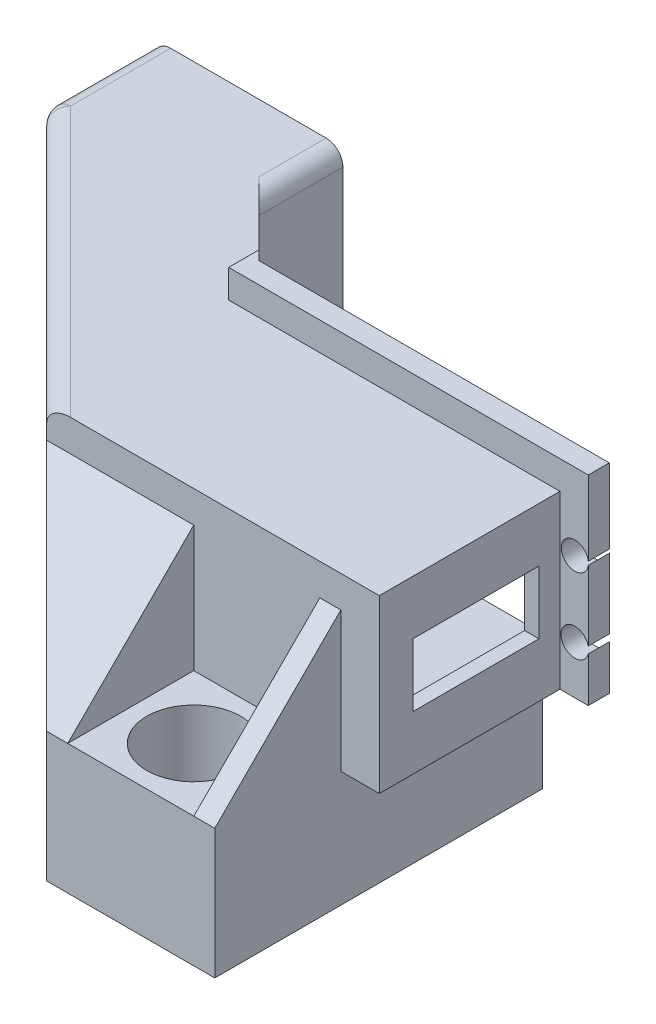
ISO-10303-21;
HEADER;
FILE_DESCRIPTION(('STEP AP214'),'2;1');
FILE_NAME('part.step','',(''),(''),'','','');
FILE_SCHEMA(('AUTOMOTIVE_DESIGN { 1 0 10303 214 1 1 1 1 }'));
ENDSEC;
DATA;
#1=APPLICATION_CONTEXT('core data for automotive mechanical design processes');
#2=APPLICATION_PROTOCOL_DEFINITION('international standard','automotive_design',2000,#1);
#3=PRODUCT_CONTEXT('',#1,'mechanical');
#4=PRODUCT('Part','Part','',(#3));
#5=PRODUCT_RELATED_PRODUCT_CATEGORY('part','',(#4));
#6=PRODUCT_DEFINITION_FORMATION('','',#4);
#7=PRODUCT_DEFINITION_CONTEXT('part definition',#1,'design');
#8=PRODUCT_DEFINITION('design','',#6,#7);
#9=PRODUCT_DEFINITION_SHAPE('','',#8);
#10=(LENGTH_UNIT() NAMED_UNIT(*) SI_UNIT(.MILLI.,.METRE.));
#11=(NAMED_UNIT(*) PLANE_ANGLE_UNIT() SI_UNIT($,.RADIAN.));
#12=(NAMED_UNIT(*) SI_UNIT($,.STERADIAN.) SOLID_ANGLE_UNIT());
#13=UNCERTAINTY_MEASURE_WITH_UNIT(LENGTH_MEASURE(1.E-05),#10,'distance_accuracy_value','');
#14=(GEOMETRIC_REPRESENTATION_CONTEXT(3) GLOBAL_UNCERTAINTY_ASSIGNED_CONTEXT((#13)) GLOBAL_UNIT_ASSIGNED_CONTEXT((#10,
#11,#12)) REPRESENTATION_CONTEXT('',''));
#15=CARTESIAN_POINT('',(0.,0.,0.));
#16=DIRECTION('',(0.,0.,1.));
#17=DIRECTION('',(1.,0.,0.));
#18=AXIS2_PLACEMENT_3D('',#15,#16,#17);
#19=CARTESIAN_POINT('',(-67.056,4.7625,-2.54));
#20=DIRECTION('',(0.,1.,0.));
#21=DIRECTION('',(0.,0.,1.));
#22=AXIS2_PLACEMENT_3D('',#19,#20,#21);
#23=PLANE('',#22);
#24=DIRECTION('',(1.,0.,0.));
#25=VECTOR('',#24,1.);
#26=CARTESIAN_POINT('',(-67.056,4.7625,-2.54));
#27=LINE('',#26,#25);
#28=CARTESIAN_POINT('',(-23.2605311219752,4.7625,-2.54));
#29=VERTEX_POINT('',#28);
#30=CARTESIAN_POINT('',(-20.7391,4.7625,-2.54));
#31=VERTEX_POINT('',#30);
#32=EDGE_CURVE('E971',#29,#31,#27,.T.);
#33=ORIENTED_EDGE('',*,*,#32,.F.);
#34=DIRECTION('',(0.,0.,-1.));
#35=VECTOR('',#34,1.);
#36=CARTESIAN_POINT('',(-23.2605311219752,4.7625,0.635000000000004));
#37=LINE('',#36,#35);
#38=CARTESIAN_POINT('',(-23.2605311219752,4.7625,-21.59));
#39=VERTEX_POINT('',#38);
#40=EDGE_CURVE('E978',#29,#39,#37,.T.);
#41=ORIENTED_EDGE('',*,*,#40,.T.);
#42=DIRECTION('',(1.,0.,0.));
#43=VECTOR('',#42,1.);
#44=CARTESIAN_POINT('',(-67.056,4.7625,-21.59));
#45=LINE('',#44,#43);
#46=CARTESIAN_POINT('',(-20.7391,4.7625,-21.59));
#47=VERTEX_POINT('',#46);
#48=EDGE_CURVE('E654',#39,#47,#45,.T.);
#49=ORIENTED_EDGE('',*,*,#48,.T.);
#50=DIRECTION('',(0.,0.,-1.));
#51=VECTOR('',#50,1.);
#52=CARTESIAN_POINT('',(-20.7391,4.7625,48.7281313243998));
#53=LINE('',#52,#51);
#54=EDGE_CURVE('E670',#31,#47,#53,.T.);
#55=ORIENTED_EDGE('',*,*,#54,.F.);
#56=EDGE_LOOP('',(#33,#41,#49,#55));
#57=FACE_BOUND('',#56,.T.);
#58=ADVANCED_FACE('F41',(#57),#23,.F.);
#59=CARTESIAN_POINT('',(-67.056,-4.7625,-2.54));
#60=DIRECTION('',(0.,-1.,0.));
#61=DIRECTION('',(0.,0.,-1.));
#62=AXIS2_PLACEMENT_3D('',#59,#60,#61);
#63=PLANE('',#62);
#64=DIRECTION('',(1.,0.,0.));
#65=VECTOR('',#64,1.);
#66=CARTESIAN_POINT('',(-67.056,-4.7625,-2.54));
#67=LINE('',#66,#65);
#68=CARTESIAN_POINT('',(-32.4484999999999,-4.7625,-2.54));
#69=VERTEX_POINT('',#68);
#70=CARTESIAN_POINT('',(-27.0314688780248,-4.7625,-2.54));
#71=VERTEX_POINT('',#70);
#72=EDGE_CURVE('E646',#69,#71,#67,.T.);
#73=ORIENTED_EDGE('',*,*,#72,.T.);
#74=DIRECTION('',(0.,0.,-1.));
#75=VECTOR('',#74,1.);
#76=CARTESIAN_POINT('',(-27.0314688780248,-4.7625,0.635000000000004));
#77=LINE('',#76,#75);
#78=CARTESIAN_POINT('',(-27.0314688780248,-4.7625,-21.59));
#79=VERTEX_POINT('',#78);
#80=EDGE_CURVE('E49',#71,#79,#77,.T.);
#81=ORIENTED_EDGE('',*,*,#80,.T.);
#82=DIRECTION('',(1.,0.,0.));
#83=VECTOR('',#82,1.);
#84=CARTESIAN_POINT('',(-67.056,-4.7625,-21.59));
#85=LINE('',#84,#83);
#86=CARTESIAN_POINT('',(-51.4984999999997,-4.7625,-21.59));
#87=VERTEX_POINT('',#86);
#88=EDGE_CURVE('E643',#87,#79,#85,.T.);
#89=ORIENTED_EDGE('',*,*,#88,.F.);
#90=DIRECTION('',(0.707106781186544,0.,0.707106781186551));
#91=VECTOR('',#90,1.);
#92=CARTESIAN_POINT('',(-8.3185,-4.7625,21.5900000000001));
#93=LINE('',#92,#91);
#94=EDGE_CURVE('E625',#69,#87,#93,.F.);
#95=ORIENTED_EDGE('',*,*,#94,.F.);
#96=EDGE_LOOP('',(#73,#81,#89,#95));
#97=FACE_BOUND('',#96,.T.);
#98=ADVANCED_FACE('F642',(#97),#63,.F.);
#99=CARTESIAN_POINT('',(22.8981,-12.954,-92.303063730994));
#100=DIRECTION('',(0.,-1.,0.));
#101=DIRECTION('',(0.,0.,-1.));
#102=AXIS2_PLACEMENT_3D('',#99,#100,#101);
#103=PLANE('',#102);
#104=DIRECTION('',(-1.,0.,0.));
#105=VECTOR('',#104,1.);
#106=CARTESIAN_POINT('',(-67.056,-12.954,-53.34));
#107=LINE('',#106,#105);
#108=CARTESIAN_POINT('',(-41.021,-12.954,-53.34));
#109=VERTEX_POINT('',#108);
#110=CARTESIAN_POINT('',(-64.516,-12.954,-53.34));
#111=VERTEX_POINT('',#110);
#112=EDGE_CURVE('E707',#109,#111,#107,.T.);
#113=ORIENTED_EDGE('',*,*,#112,.F.);
#114=DIRECTION('',(0.,0.,1.));
#115=VECTOR('',#114,1.);
#116=CARTESIAN_POINT('',(-41.021,-12.954,-40.6400000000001));
#117=LINE('',#116,#115);
#118=CARTESIAN_POINT('',(-41.021,-12.954,-43.1800000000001));
#119=VERTEX_POINT('',#118);
#120=EDGE_CURVE('E579',#109,#119,#117,.T.);
#121=ORIENTED_EDGE('',*,*,#120,.T.);
#122=DIRECTION('',(0.707106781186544,0.,0.707106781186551));
#123=VECTOR('',#122,1.);
#124=CARTESIAN_POINT('',(-38.481,-12.954,-40.6400000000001));
#125=LINE('',#124,#123);
#126=CARTESIAN_POINT('',(-33.401,-12.954,-35.56));
#127=VERTEX_POINT('',#126);
#128=EDGE_CURVE('E512',#119,#127,#125,.T.);
#129=ORIENTED_EDGE('',*,*,#128,.T.);
#130=DIRECTION('',(1.,0.,0.));
#131=VECTOR('',#130,1.);
#132=CARTESIAN_POINT('',(-67.056,-12.954,-35.56));
#133=LINE('',#132,#131);
#134=CARTESIAN_POINT('',(-59.336397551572,-12.954,-35.56));
#135=VERTEX_POINT('',#134);
#136=EDGE_CURVE('E683',#135,#127,#133,.T.);
#137=ORIENTED_EDGE('',*,*,#136,.F.);
#138=CARTESIAN_POINT('',(-59.336397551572,-12.954,-33.02));
#139=DIRECTION('',(0.,-1.,0.));
#140=DIRECTION('',(0.,0.,-1.));
#141=AXIS2_PLACEMENT_3D('',#138,#139,#140);
#142=CIRCLE('',#141,2.54);
#143=CARTESIAN_POINT('',(-61.1324487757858,-12.954,-34.8160512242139));
#144=VERTEX_POINT('',#143);
#145=EDGE_CURVE('E548',#135,#144,#142,.F.);
#146=ORIENTED_EDGE('',*,*,#145,.T.);
#147=DIRECTION('',(-0.707106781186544,0.,-0.707106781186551));
#148=VECTOR('',#147,1.);
#149=CARTESIAN_POINT('',(-64.516,-12.954,-38.1996024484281));
#150=LINE('',#149,#148);
#151=CARTESIAN_POINT('',(-64.516,-12.954,-38.1996024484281));
#152=VERTEX_POINT('',#151);
#153=EDGE_CURVE('E577',#144,#152,#150,.T.);
#154=ORIENTED_EDGE('',*,*,#153,.T.);
#155=DIRECTION('',(0.,0.,1.));
#156=VECTOR('',#155,1.);
#157=CARTESIAN_POINT('',(-64.516,-12.954,-53.34));
#158=LINE('',#157,#156);
#159=EDGE_CURVE('E575',#152,#111,#158,.F.);
#160=ORIENTED_EDGE('',*,*,#159,.T.);
#161=EDGE_LOOP('',(#113,#121,#129,#137,#146,#154,#160));
#162=FACE_BOUND('',#161,.T.);
#163=ADVANCED_FACE('F953',(#162),#103,.T.);
#164=CARTESIAN_POINT('',(-38.481,12.954,-53.34));
#165=DIRECTION('',(-1.,0.,0.));
#166=DIRECTION('',(0.,0.,1.));
#167=AXIS2_PLACEMENT_3D('',#164,#165,#166);
#168=PLANE('',#167);
#169=DIRECTION('',(0.,-1.,0.));
#170=VECTOR('',#169,1.);
#171=CARTESIAN_POINT('',(-38.481,12.954,-40.6400000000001));
#172=LINE('',#171,#170);
#173=CARTESIAN_POINT('',(-38.481,10.414,-40.6400000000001));
#174=VERTEX_POINT('',#173);
#175=CARTESIAN_POINT('',(-38.481,-10.414,-40.6400000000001));
#176=VERTEX_POINT('',#175);
#177=EDGE_CURVE('E503',#174,#176,#172,.T.);
#178=ORIENTED_EDGE('',*,*,#177,.T.);
#179=DIRECTION('',(0.,0.,1.));
#180=VECTOR('',#179,1.);
#181=CARTESIAN_POINT('',(-38.481,-10.414,-53.34));
#182=LINE('',#181,#180);
#183=CARTESIAN_POINT('',(-38.481,-10.414,-53.34));
#184=VERTEX_POINT('',#183);
#185=EDGE_CURVE('E585',#176,#184,#182,.F.);
#186=ORIENTED_EDGE('',*,*,#185,.T.);
#187=DIRECTION('',(0.,-1.,0.));
#188=VECTOR('',#187,1.);
#189=CARTESIAN_POINT('',(-38.481,12.954,-53.34));
#190=LINE('',#189,#188);
#191=CARTESIAN_POINT('',(-38.481,10.414,-53.34));
#192=VERTEX_POINT('',#191);
#193=EDGE_CURVE('E704',#192,#184,#190,.T.);
#194=ORIENTED_EDGE('',*,*,#193,.F.);
#195=DIRECTION('',(0.,0.,1.));
#196=VECTOR('',#195,1.);
#197=CARTESIAN_POINT('',(-38.481,10.414,-40.6400000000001));
#198=LINE('',#197,#196);
#199=EDGE_CURVE('E582',#192,#174,#198,.T.);
#200=ORIENTED_EDGE('',*,*,#199,.T.);
#201=EDGE_LOOP('',(#178,#186,#194,#200));
#202=FACE_BOUND('',#201,.T.);
#203=ADVANCED_FACE('F1094',(#202),#168,.F.);
#204=CARTESIAN_POINT('',(-27.178,17.2339,-92.303063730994));
#205=DIRECTION('',(-1.,0.,0.));
#206=DIRECTION('',(0.,0.,1.));
#207=AXIS2_PLACEMENT_3D('',#204,#205,#206);
#208=PLANE('',#207);
#209=DIRECTION('',(0.,0.,1.));
#210=VECTOR('',#209,1.);
#211=CARTESIAN_POINT('',(-27.178,17.2339,-92.303063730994));
#212=LINE('',#211,#210);
#213=CARTESIAN_POINT('',(-27.178,17.2339,-29.337));
#214=VERTEX_POINT('',#213);
#215=CARTESIAN_POINT('',(-27.178,17.2339,-24.765));
#216=VERTEX_POINT('',#215);
#217=EDGE_CURVE('E468',#214,#216,#212,.T.);
#218=ORIENTED_EDGE('',*,*,#217,.F.);
#219=DIRECTION('',(0.,-1.,0.));
#220=VECTOR('',#219,1.);
#221=CARTESIAN_POINT('',(-27.178,12.954,-29.337));
#222=LINE('',#221,#220);
#223=CARTESIAN_POINT('',(-27.178,12.954,-29.337));
#224=VERTEX_POINT('',#223);
#225=EDGE_CURVE('E531',#214,#224,#222,.T.);
#226=ORIENTED_EDGE('',*,*,#225,.T.);
#227=DIRECTION('',(0.,0.,-1.));
#228=VECTOR('',#227,1.);
#229=CARTESIAN_POINT('',(-27.178,12.954,-24.765));
#230=LINE('',#229,#228);
#231=CARTESIAN_POINT('',(-27.178,12.954,-24.765));
#232=VERTEX_POINT('',#231);
#233=EDGE_CURVE('E689',#232,#224,#230,.T.);
#234=ORIENTED_EDGE('',*,*,#233,.F.);
#235=DIRECTION('',(0.,-1.,0.));
#236=VECTOR('',#235,1.);
#237=CARTESIAN_POINT('',(-27.178,17.2339,-24.765));
#238=LINE('',#237,#236);
#239=EDGE_CURVE('E437',#216,#232,#238,.T.);
#240=ORIENTED_EDGE('',*,*,#239,.F.);
#241=EDGE_LOOP('',(#218,#226,#234,#240));
#242=FACE_BOUND('',#241,.T.);
#243=ADVANCED_FACE('F912',(#242),#208,.T.);
#244=CARTESIAN_POINT('',(0.,0.,-24.765));
#245=DIRECTION('',(0.,0.,-1.));
#246=DIRECTION('',(0.,-1.,0.));
#247=AXIS2_PLACEMENT_3D('',#244,#245,#246);
#248=PLANE('',#247);
#249=ORIENTED_EDGE('',*,*,#239,.T.);
#250=DIRECTION('',(-1.,0.,0.));
#251=VECTOR('',#250,1.);
#252=CARTESIAN_POINT('',(22.8981,12.954,-24.765));
#253=LINE('',#252,#251);
#254=CARTESIAN_POINT('',(22.8981,12.954,-24.765));
#255=VERTEX_POINT('',#254);
#256=EDGE_CURVE('E438',#255,#232,#253,.T.);
#257=ORIENTED_EDGE('',*,*,#256,.F.);
#258=DIRECTION('',(0.,1.,0.));
#259=VECTOR('',#258,1.);
#260=CARTESIAN_POINT('',(22.8981,-12.954,-24.765));
#261=LINE('',#260,#259);
#262=CARTESIAN_POINT('',(22.8981,-12.954,-24.765));
#263=VERTEX_POINT('',#262);
#264=EDGE_CURVE('E441',#263,#255,#261,.T.);
#265=ORIENTED_EDGE('',*,*,#264,.F.);
#266=DIRECTION('',(-1.,0.,0.));
#267=VECTOR('',#266,1.);
#268=CARTESIAN_POINT('',(27.178,-12.954,-24.765));
#269=LINE('',#268,#267);
#270=CARTESIAN_POINT('',(27.178,-12.954,-24.765));
#271=VERTEX_POINT('',#270);
#272=EDGE_CURVE('E710',#271,#263,#269,.T.);
#273=ORIENTED_EDGE('',*,*,#272,.F.);
#274=DIRECTION('',(0.,1.,0.));
#275=VECTOR('',#274,1.);
#276=CARTESIAN_POINT('',(27.178,17.2339,-24.765));
#277=LINE('',#276,#275);
#278=CARTESIAN_POINT('',(27.178,-6.18885336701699,-24.765));
#279=VERTEX_POINT('',#278);
#280=EDGE_CURVE('E451',#271,#279,#277,.T.);
#281=ORIENTED_EDGE('',*,*,#280,.T.);
#282=CARTESIAN_POINT('',(25.146,-5.6769,-24.765));
#283=DIRECTION('',(0.,0.,-1.));
#284=DIRECTION('',(-1.,0.,0.));
#285=AXIS2_PLACEMENT_3D('',#282,#283,#284);
#286=CIRCLE('',#285,2.0955);
#287=CARTESIAN_POINT('',(27.178,-5.16494663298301,-24.765));
#288=VERTEX_POINT('',#287);
#289=EDGE_CURVE('E481',#279,#288,#286,.T.);
#290=ORIENTED_EDGE('',*,*,#289,.T.);
#291=CARTESIAN_POINT('',(27.178,5.40824906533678,-24.765));
#292=VERTEX_POINT('',#291);
#293=EDGE_CURVE('E454',#288,#292,#277,.T.);
#294=ORIENTED_EDGE('',*,*,#293,.T.);
#295=CARTESIAN_POINT('',(25.146,5.6769,-24.765));
#296=DIRECTION('',(0.,0.,-1.));
#297=DIRECTION('',(-1.,0.,0.));
#298=AXIS2_PLACEMENT_3D('',#295,#296,#297);
#299=CIRCLE('',#298,2.04968224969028);
#300=CARTESIAN_POINT('',(27.178,5.94555093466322,-24.765));
#301=VERTEX_POINT('',#300);
#302=EDGE_CURVE('E474',#292,#301,#299,.T.);
#303=ORIENTED_EDGE('',*,*,#302,.T.);
#304=CARTESIAN_POINT('',(27.178,17.2339,-24.765));
#305=VERTEX_POINT('',#304);
#306=EDGE_CURVE('E450',#301,#305,#277,.T.);
#307=ORIENTED_EDGE('',*,*,#306,.T.);
#308=DIRECTION('',(-1.,0.,0.));
#309=VECTOR('',#308,1.);
#310=CARTESIAN_POINT('',(27.178,17.2339,-24.765));
#311=LINE('',#310,#309);
#312=EDGE_CURVE('E448',#305,#216,#311,.T.);
#313=ORIENTED_EDGE('',*,*,#312,.T.);
#314=EDGE_LOOP('',(#249,#257,#265,#273,#281,#290,#294,#303,#307,#313));
#315=FACE_BOUND('',#314,.T.);
#316=ADVANCED_FACE('F910',(#315),#248,.F.);
#317=CARTESIAN_POINT('',(4.3815,-29.9339,12.065));
#318=DIRECTION('',(0.,1.,0.));
#319=DIRECTION('',(0.,0.,1.));
#320=AXIS2_PLACEMENT_3D('',#317,#318,#319);
#321=CYLINDRICAL_SURFACE('',#320,4.318);
#322=CARTESIAN_POINT('',(4.3815,-30.48,12.065));
#323=DIRECTION('',(0.,-1.,0.));
#324=DIRECTION('',(1.,0.,0.));
#325=AXIS2_PLACEMENT_3D('',#322,#323,#324);
#326=CIRCLE('',#325,4.318);
#327=CARTESIAN_POINT('',(4.3815,-30.48,16.383));
#328=VERTEX_POINT('',#327);
#329=EDGE_CURVE('E500',#328,#328,#326,.T.);
#330=CARTESIAN_POINT('',(4.3815,-22.9489,12.065));
#331=DIRECTION('',(0.,1.,0.));
#332=DIRECTION('',(0.,0.,1.));
#333=AXIS2_PLACEMENT_3D('',#330,#331,#332);
#334=CIRCLE('',#333,4.318);
#335=CARTESIAN_POINT('',(4.3815,-22.9489,16.383));
#336=VERTEX_POINT('',#335);
#337=EDGE_CURVE('E498',#336,#336,#334,.F.);
#338=CARTESIAN_POINT('',(4.3815,-30.48,16.383));
#339=CARTESIAN_POINT('',(4.3815,-30.4015510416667,16.383));
#340=CARTESIAN_POINT('',(4.3815,-30.3231020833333,16.383));
#341=CARTESIAN_POINT('',(4.3815,-30.1662041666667,16.383));
#342=CARTESIAN_POINT('',(4.3815,-30.0877552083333,16.383));
#343=CARTESIAN_POINT('',(4.3815,-29.9308572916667,16.383));
#344=CARTESIAN_POINT('',(4.3815,-29.8524083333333,16.383));
#345=CARTESIAN_POINT('',(4.3815,-29.6955104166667,16.383));
#346=CARTESIAN_POINT('',(4.3815,-29.6170614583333,16.383));
#347=CARTESIAN_POINT('',(4.3815,-29.4601635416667,16.383));
#348=CARTESIAN_POINT('',(4.3815,-29.3817145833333,16.383));
#349=CARTESIAN_POINT('',(4.3815,-29.2248166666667,16.383));
#350=CARTESIAN_POINT('',(4.3815,-29.1463677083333,16.383));
#351=CARTESIAN_POINT('',(4.3815,-28.9894697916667,16.383));
#352=CARTESIAN_POINT('',(4.3815,-28.9110208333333,16.383));
#353=CARTESIAN_POINT('',(4.3815,-28.7541229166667,16.383));
#354=CARTESIAN_POINT('',(4.3815,-28.6756739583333,16.383));
#355=CARTESIAN_POINT('',(4.3815,-28.5187760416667,16.383));
#356=CARTESIAN_POINT('',(4.3815,-28.4403270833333,16.383));
#357=CARTESIAN_POINT('',(4.3815,-28.2834291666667,16.383));
#358=CARTESIAN_POINT('',(4.3815,-28.2049802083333,16.383));
#359=CARTESIAN_POINT('',(4.3815,-28.0480822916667,16.383));
#360=CARTESIAN_POINT('',(4.3815,-27.9696333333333,16.383));
#361=CARTESIAN_POINT('',(4.3815,-27.8127354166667,16.383));
#362=CARTESIAN_POINT('',(4.3815,-27.7342864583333,16.383));
#363=CARTESIAN_POINT('',(4.3815,-27.5773885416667,16.383));
#364=CARTESIAN_POINT('',(4.3815,-27.4989395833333,16.383));
#365=CARTESIAN_POINT('',(4.3815,-27.3420416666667,16.383));
#366=CARTESIAN_POINT('',(4.3815,-27.2635927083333,16.383));
#367=CARTESIAN_POINT('',(4.3815,-27.1066947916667,16.383));
#368=CARTESIAN_POINT('',(4.3815,-27.0282458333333,16.383));
#369=CARTESIAN_POINT('',(4.3815,-26.8713479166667,16.383));
#370=CARTESIAN_POINT('',(4.3815,-26.7928989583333,16.383));
#371=CARTESIAN_POINT('',(4.3815,-26.6360010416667,16.383));
#372=CARTESIAN_POINT('',(4.3815,-26.5575520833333,16.383));
#373=CARTESIAN_POINT('',(4.3815,-26.4006541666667,16.383));
#374=CARTESIAN_POINT('',(4.3815,-26.3222052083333,16.383));
#375=CARTESIAN_POINT('',(4.3815,-26.1653072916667,16.383));
#376=CARTESIAN_POINT('',(4.3815,-26.0868583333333,16.383));
#377=CARTESIAN_POINT('',(4.3815,-25.9299604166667,16.383));
#378=CARTESIAN_POINT('',(4.3815,-25.8515114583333,16.383));
#379=CARTESIAN_POINT('',(4.3815,-25.6946135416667,16.383));
#380=CARTESIAN_POINT('',(4.3815,-25.6161645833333,16.383));
#381=CARTESIAN_POINT('',(4.3815,-25.4592666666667,16.383));
#382=CARTESIAN_POINT('',(4.3815,-25.3808177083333,16.383));
#383=CARTESIAN_POINT('',(4.3815,-25.2239197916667,16.383));
#384=CARTESIAN_POINT('',(4.3815,-25.1454708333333,16.383));
#385=CARTESIAN_POINT('',(4.3815,-24.9885729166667,16.383));
#386=CARTESIAN_POINT('',(4.3815,-24.9101239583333,16.383));
#387=CARTESIAN_POINT('',(4.3815,-24.7532260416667,16.383));
#388=CARTESIAN_POINT('',(4.3815,-24.6747770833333,16.383));
#389=CARTESIAN_POINT('',(4.3815,-24.5178791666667,16.383));
#390=CARTESIAN_POINT('',(4.3815,-24.4394302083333,16.383));
#391=CARTESIAN_POINT('',(4.3815,-24.2825322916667,16.383));
#392=CARTESIAN_POINT('',(4.3815,-24.2040833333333,16.383));
#393=CARTESIAN_POINT('',(4.3815,-24.0471854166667,16.383));
#394=CARTESIAN_POINT('',(4.3815,-23.9687364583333,16.383));
#395=CARTESIAN_POINT('',(4.3815,-23.8118385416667,16.383));
#396=CARTESIAN_POINT('',(4.3815,-23.7333895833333,16.383));
#397=CARTESIAN_POINT('',(4.3815,-23.5764916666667,16.383));
#398=CARTESIAN_POINT('',(4.3815,-23.4980427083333,16.383));
#399=CARTESIAN_POINT('',(4.3815,-23.3411447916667,16.383));
#400=CARTESIAN_POINT('',(4.3815,-23.2626958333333,16.383));
#401=CARTESIAN_POINT('',(4.3815,-23.1057979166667,16.383));
#402=CARTESIAN_POINT('',(4.3815,-23.0273489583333,16.383));
#403=CARTESIAN_POINT('',(4.3815,-22.9489,16.383));
#404=B_SPLINE_CURVE_WITH_KNOTS('',3,(#338,#339,#340,#341,#342,#343,#344,#345,#346,#347,#348,
#349,#350,#351,#352,#353,#354,#355,#356,#357,#358,#359,#360,#361,#362,#363,#364,#365,#366,#367,
#368,#369,#370,#371,#372,#373,#374,#375,#376,#377,#378,#379,#380,#381,#382,#383,#384,#385,#386,
#387,#388,#389,#390,#391,#392,#393,#394,#395,#396,#397,#398,#399,#400,#401,#402,#403),
.UNSPECIFIED.,.F.,.F.,(4,2,2,2,2,2,2,2,2,2,2,2,2,2,2,2,2,2,2,2,2,2,2,2,2,2,2,2,2,2,2,2,4),(0.,
0.235346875,0.470693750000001,0.706040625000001,0.941387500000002,1.176734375,1.41208125,
1.647428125,1.882775,2.118121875,2.35346875,2.588815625,2.8241625,3.059509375,3.29485625,
3.530203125,3.76555,4.000896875,4.23624375,4.471590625,4.7069375,4.942284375,5.17763125,
5.412978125,5.648325,5.883671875,6.11901875,6.354365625,6.5897125,6.825059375,7.06040625,
7.295753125,7.5311),.UNSPECIFIED.);
#405=EDGE_CURVE('BSEAM1028',#328,#336,#404,.T.);
#406=ORIENTED_EDGE('',*,*,#329,.T.);
#407=ORIENTED_EDGE('',*,*,#337,.F.);
#408=ORIENTED_EDGE('',*,*,#405,.T.);
#409=ORIENTED_EDGE('',*,*,#405,.F.);
#410=EDGE_LOOP('',(#406,#408,#407,#409));
#411=FACE_BOUND('',#410,.T.);
#412=ADVANCED_FACE('F1028',(#411),#321,.F.);
#413=CARTESIAN_POINT('',(0.,0.,2.54));
#414=DIRECTION('',(0.,0.,1.));
#415=DIRECTION('',(1.,0.,0.));
#416=AXIS2_PLACEMENT_3D('',#413,#414,#415);
#417=PLANE('',#416);
#418=DIRECTION('',(-1.,0.,0.));
#419=VECTOR('',#418,1.);
#420=CARTESIAN_POINT('',(-22.8981,12.954,2.54));
#421=LINE('',#420,#419);
#422=CARTESIAN_POINT('',(22.8981,12.954,2.54));
#423=VERTEX_POINT('',#422);
#424=CARTESIAN_POINT('',(-23.7763975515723,12.954,2.54));
#425=VERTEX_POINT('',#424);
#426=EDGE_CURVE('E839',#423,#425,#421,.T.);
#427=ORIENTED_EDGE('',*,*,#426,.T.);
#428=CARTESIAN_POINT('',(-23.7763975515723,10.414,2.54));
#429=DIRECTION('',(0.,0.,1.));
#430=DIRECTION('',(-1.,0.,0.));
#431=AXIS2_PLACEMENT_3D('',#428,#429,#430);
#432=ELLIPSE('',#431,3.59210244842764,2.54);
#433=CARTESIAN_POINT('',(-27.3684999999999,10.414,2.54));
#434=VERTEX_POINT('',#433);
#435=EDGE_CURVE('E569',#425,#434,#432,.T.);
#436=ORIENTED_EDGE('',*,*,#435,.T.);
#437=DIRECTION('',(0.,-1.,0.));
#438=VECTOR('',#437,1.);
#439=CARTESIAN_POINT('',(-27.3685,0.,2.54));
#440=LINE('',#439,#438);
#441=CARTESIAN_POINT('',(-27.3684999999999,8.1661,2.54000000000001));
#442=VERTEX_POINT('',#441);
#443=EDGE_CURVE('E678',#442,#434,#440,.F.);
#444=ORIENTED_EDGE('',*,*,#443,.F.);
#445=DIRECTION('',(-1.,0.,0.));
#446=VECTOR('',#445,1.);
#447=CARTESIAN_POINT('',(-8.3185,8.1661,2.54));
#448=LINE('',#447,#446);
#449=CARTESIAN_POINT('',(-5.1435,8.1661,2.54));
#450=VERTEX_POINT('',#449);
#451=EDGE_CURVE('E799',#450,#442,#448,.T.);
#452=ORIENTED_EDGE('',*,*,#451,.F.);
#453=DIRECTION('',(0.,-1.,0.));
#454=VECTOR('',#453,1.);
#455=CARTESIAN_POINT('',(-5.1435,8.1661,2.54));
#456=LINE('',#455,#454);
#457=CARTESIAN_POINT('',(-5.1435,-10.8839,2.54));
#458=VERTEX_POINT('',#457);
#459=EDGE_CURVE('E802',#450,#458,#456,.T.);
#460=ORIENTED_EDGE('',*,*,#459,.T.);
#461=DIRECTION('',(-1.,0.,0.));
#462=VECTOR('',#461,1.);
#463=CARTESIAN_POINT('',(-8.3185,-10.8839,2.54));
#464=LINE('',#463,#462);
#465=CARTESIAN_POINT('',(13.9065,-10.8839,2.54));
#466=VERTEX_POINT('',#465);
#467=EDGE_CURVE('E817',#466,#458,#464,.T.);
#468=ORIENTED_EDGE('',*,*,#467,.F.);
#469=DIRECTION('',(0.,-1.,0.));
#470=VECTOR('',#469,1.);
#471=CARTESIAN_POINT('',(13.9065,8.1661,2.54));
#472=LINE('',#471,#470);
#473=CARTESIAN_POINT('',(13.9065,8.1661,2.54));
#474=VERTEX_POINT('',#473);
#475=EDGE_CURVE('E810',#474,#466,#472,.T.);
#476=ORIENTED_EDGE('',*,*,#475,.F.);
#477=DIRECTION('',(-1.,0.,0.));
#478=VECTOR('',#477,1.);
#479=CARTESIAN_POINT('',(17.0815,8.1661,2.54));
#480=LINE('',#479,#478);
#481=CARTESIAN_POINT('',(17.0815,8.1661,2.54));
#482=VERTEX_POINT('',#481);
#483=EDGE_CURVE('E807',#482,#474,#480,.T.);
#484=ORIENTED_EDGE('',*,*,#483,.F.);
#485=DIRECTION('',(0.,1.,0.));
#486=VECTOR('',#485,1.);
#487=CARTESIAN_POINT('',(17.0815,-17.2339,2.54));
#488=LINE('',#487,#486);
#489=CARTESIAN_POINT('',(17.0815,-12.954,2.54));
#490=VERTEX_POINT('',#489);
#491=EDGE_CURVE('E484',#490,#482,#488,.T.);
#492=ORIENTED_EDGE('',*,*,#491,.F.);
#493=DIRECTION('',(1.,0.,0.));
#494=VECTOR('',#493,1.);
#495=CARTESIAN_POINT('',(-22.8981,-12.954,2.54));
#496=LINE('',#495,#494);
#497=CARTESIAN_POINT('',(22.8981,-12.954,2.54));
#498=VERTEX_POINT('',#497);
#499=EDGE_CURVE('E834',#490,#498,#496,.T.);
#500=ORIENTED_EDGE('',*,*,#499,.T.);
#501=DIRECTION('',(0.,1.,0.));
#502=VECTOR('',#501,1.);
#503=CARTESIAN_POINT('',(22.8981,12.954,2.54));
#504=LINE('',#503,#502);
#505=EDGE_CURVE('E836',#498,#423,#504,.T.);
#506=ORIENTED_EDGE('',*,*,#505,.T.);
#507=EDGE_LOOP('',(#427,#436,#444,#452,#460,#468,#476,#484,#492,#500,#506));
#508=FACE_BOUND('',#507,.T.);
#509=ADVANCED_FACE('F1024',(#508),#417,.T.);
#510=CARTESIAN_POINT('',(-8.3185,-10.8839,21.59));
#511=DIRECTION('',(0.,-1.,0.));
#512=DIRECTION('',(0.,0.,-1.));
#513=AXIS2_PLACEMENT_3D('',#510,#511,#512);
#514=PLANE('',#513);
#515=CARTESIAN_POINT('',(4.3815,-10.8839,12.065));
#516=DIRECTION('',(0.,1.,0.));
#517=DIRECTION('',(0.,0.,1.));
#518=AXIS2_PLACEMENT_3D('',#515,#516,#517);
#519=CIRCLE('',#518,7.112);
#520=CARTESIAN_POINT('',(4.3815,-10.8839,19.177));
#521=VERTEX_POINT('',#520);
#522=EDGE_CURVE('E814',#521,#521,#519,.T.);
#523=ORIENTED_EDGE('',*,*,#522,.F.);
#524=EDGE_LOOP('',(#523));
#525=FACE_BOUND('',#524,.T.);
#526=DIRECTION('',(0.,0.,-1.));
#527=VECTOR('',#526,1.);
#528=CARTESIAN_POINT('',(-5.1435,-10.8839,21.59));
#529=LINE('',#528,#527);
#530=CARTESIAN_POINT('',(-5.1435,-10.8839,21.59));
#531=VERTEX_POINT('',#530);
#532=EDGE_CURVE('E798',#531,#458,#529,.T.);
#533=ORIENTED_EDGE('',*,*,#532,.F.);
#534=DIRECTION('',(-1.,0.,0.));
#535=VECTOR('',#534,1.);
#536=CARTESIAN_POINT('',(-8.3185,-10.8839,21.59));
#537=LINE('',#536,#535);
#538=CARTESIAN_POINT('',(13.9065,-10.8839,21.59));
#539=VERTEX_POINT('',#538);
#540=EDGE_CURVE('E824',#539,#531,#537,.T.);
#541=ORIENTED_EDGE('',*,*,#540,.F.);
#542=DIRECTION('',(0.,0.,1.));
#543=VECTOR('',#542,1.);
#544=CARTESIAN_POINT('',(13.9065,-10.8839,21.59));
#545=LINE('',#544,#543);
#546=EDGE_CURVE('E806',#466,#539,#545,.T.);
#547=ORIENTED_EDGE('',*,*,#546,.F.);
#548=ORIENTED_EDGE('',*,*,#467,.T.);
#549=EDGE_LOOP('',(#533,#541,#547,#548));
#550=FACE_BOUND('',#549,.T.);
#551=ADVANCED_FACE('F1027',(#525,#550),#514,.F.);
#552=DIRECTION('',(0.,0.,1.));
#553=VECTOR('',#552,1.);
#554=CARTESIAN_POINT('',(17.0815,-12.954,-50.5230578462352));
#555=LINE('',#554,#553);
#556=CARTESIAN_POINT('',(17.0815,-12.954,-27.94));
#557=VERTEX_POINT('',#556);
#558=EDGE_CURVE('E827',#557,#490,#555,.T.);
#559=ORIENTED_EDGE('',*,*,#558,.F.);
#560=DIRECTION('',(-1.,0.,0.));
#561=VECTOR('',#560,1.);
#562=CARTESIAN_POINT('',(27.178,-12.954,-27.94));
#563=LINE('',#562,#561);
#564=CARTESIAN_POINT('',(27.178,-12.954,-27.94));
#565=VERTEX_POINT('',#564);
#566=EDGE_CURVE('E712',#565,#557,#563,.T.);
#567=ORIENTED_EDGE('',*,*,#566,.F.);
#568=DIRECTION('',(0.,0.,1.));
#569=VECTOR('',#568,1.);
#570=CARTESIAN_POINT('',(27.178,-12.954,-53.6857067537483));
#571=LINE('',#570,#569);
#572=EDGE_CURVE('E718',#565,#271,#571,.T.);
#573=ORIENTED_EDGE('',*,*,#572,.T.);
#574=ORIENTED_EDGE('',*,*,#272,.T.);
#575=DIRECTION('',(0.,0.,1.));
#576=VECTOR('',#575,1.);
#577=CARTESIAN_POINT('',(22.8981,-12.954,-92.303063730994));
#578=LINE('',#577,#576);
#579=EDGE_CURVE('E442',#263,#498,#578,.T.);
#580=ORIENTED_EDGE('',*,*,#579,.T.);
#581=ORIENTED_EDGE('',*,*,#499,.F.);
#582=EDGE_LOOP('',(#559,#567,#573,#574,#580,#581));
#583=FACE_BOUND('',#582,.T.);
#584=ADVANCED_FACE('F927',(#583),#103,.T.);
#585=CARTESIAN_POINT('',(27.178,17.2339,-92.303063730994));
#586=DIRECTION('',(1.,0.,0.));
#587=DIRECTION('',(0.,0.,-1.));
#588=AXIS2_PLACEMENT_3D('',#585,#586,#587);
#589=PLANE('',#588);
#590=ORIENTED_EDGE('',*,*,#572,.F.);
#591=DIRECTION('',(0.,1.,0.));
#592=VECTOR('',#591,1.);
#593=CARTESIAN_POINT('',(27.178,17.2339,-27.94));
#594=LINE('',#593,#592);
#595=CARTESIAN_POINT('',(27.178,-6.18885336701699,-27.94));
#596=VERTEX_POINT('',#595);
#597=EDGE_CURVE('E469',#565,#596,#594,.T.);
#598=ORIENTED_EDGE('',*,*,#597,.T.);
#599=DIRECTION('',(0.,0.,-1.));
#600=VECTOR('',#599,1.);
#601=CARTESIAN_POINT('',(27.178,-6.18885336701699,0.));
#602=LINE('',#601,#600);
#603=EDGE_CURVE('E432',#279,#596,#602,.T.);
#604=ORIENTED_EDGE('',*,*,#603,.F.);
#605=ORIENTED_EDGE('',*,*,#280,.F.);
#606=EDGE_LOOP('',(#590,#598,#604,#605));
#607=FACE_BOUND('',#606,.T.);
#608=ADVANCED_FACE('F929',(#607),#589,.T.);
#609=DIRECTION('',(0.,0.,-1.));
#610=VECTOR('',#609,1.);
#611=CARTESIAN_POINT('',(27.178,-5.16494663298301,0.));
#612=LINE('',#611,#610);
#613=CARTESIAN_POINT('',(27.178,-5.16494663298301,-27.94));
#614=VERTEX_POINT('',#613);
#615=EDGE_CURVE('E876',#614,#288,#612,.F.);
#616=ORIENTED_EDGE('',*,*,#615,.F.);
#617=CARTESIAN_POINT('',(27.178,5.40824906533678,-27.94));
#618=VERTEX_POINT('',#617);
#619=EDGE_CURVE('E471',#614,#618,#594,.T.);
#620=ORIENTED_EDGE('',*,*,#619,.T.);
#621=DIRECTION('',(0.,0.,-1.));
#622=VECTOR('',#621,1.);
#623=CARTESIAN_POINT('',(27.178,5.40824906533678,0.));
#624=LINE('',#623,#622);
#625=EDGE_CURVE('E874',#292,#618,#624,.T.);
#626=ORIENTED_EDGE('',*,*,#625,.F.);
#627=ORIENTED_EDGE('',*,*,#293,.F.);
#628=EDGE_LOOP('',(#616,#620,#626,#627));
#629=FACE_BOUND('',#628,.T.);
#630=ADVANCED_FACE('F932',(#629),#589,.T.);
#631=CARTESIAN_POINT('',(27.178,17.2339,-92.303063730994));
#632=DIRECTION('',(0.,1.,0.));
#633=DIRECTION('',(-1.,0.,0.));
#634=AXIS2_PLACEMENT_3D('',#631,#632,#633);
#635=PLANE('',#634);
#636=ORIENTED_EDGE('',*,*,#312,.F.);
#637=DIRECTION('',(0.,0.,1.));
#638=VECTOR('',#637,1.);
#639=CARTESIAN_POINT('',(27.178,17.2339,-92.303063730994));
#640=LINE('',#639,#638);
#641=CARTESIAN_POINT('',(27.178,17.2339,-27.94));
#642=VERTEX_POINT('',#641);
#643=EDGE_CURVE('E461',#642,#305,#640,.T.);
#644=ORIENTED_EDGE('',*,*,#643,.F.);
#645=DIRECTION('',(-1.,0.,0.));
#646=VECTOR('',#645,1.);
#647=CARTESIAN_POINT('',(27.178,17.2339,-27.94));
#648=LINE('',#647,#646);
#649=CARTESIAN_POINT('',(-25.781,17.2339,-27.94));
#650=VERTEX_POINT('',#649);
#651=EDGE_CURVE('E445',#642,#650,#648,.T.);
#652=ORIENTED_EDGE('',*,*,#651,.T.);
#653=DIRECTION('',(-0.707106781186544,0.,-0.707106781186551));
#654=VECTOR('',#653,1.);
#655=CARTESIAN_POINT('',(-38.481,17.2339,-40.6400000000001));
#656=LINE('',#655,#654);
#657=EDGE_CURVE('E528',#650,#214,#656,.T.);
#658=ORIENTED_EDGE('',*,*,#657,.T.);
#659=ORIENTED_EDGE('',*,*,#217,.T.);
#660=EDGE_LOOP('',(#636,#644,#652,#658,#659));
#661=FACE_BOUND('',#660,.T.);
#662=ADVANCED_FACE('F907',(#661),#635,.T.);
#663=DIRECTION('',(0.,0.,-1.));
#664=VECTOR('',#663,1.);
#665=CARTESIAN_POINT('',(27.178,5.94555093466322,0.));
#666=LINE('',#665,#664);
#667=CARTESIAN_POINT('',(27.178,5.94555093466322,-27.94));
#668=VERTEX_POINT('',#667);
#669=EDGE_CURVE('E872',#668,#301,#666,.F.);
#670=ORIENTED_EDGE('',*,*,#669,.F.);
#671=EDGE_CURVE('E472',#668,#642,#594,.T.);
#672=ORIENTED_EDGE('',*,*,#671,.T.);
#673=ORIENTED_EDGE('',*,*,#643,.T.);
#674=ORIENTED_EDGE('',*,*,#306,.F.);
#675=EDGE_LOOP('',(#670,#672,#673,#674));
#676=FACE_BOUND('',#675,.T.);
#677=ADVANCED_FACE('F899',(#676),#589,.T.);
#678=CARTESIAN_POINT('',(20.1041,10.16,-92.303063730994));
#679=DIRECTION('',(0.,1.,0.));
#680=DIRECTION('',(0.,0.,1.));
#681=AXIS2_PLACEMENT_3D('',#678,#679,#680);
#682=PLANE('',#681);
#683=DIRECTION('',(-1.,0.,0.));
#684=VECTOR('',#683,1.);
#685=CARTESIAN_POINT('',(20.1041,10.16,-27.94));
#686=LINE('',#685,#684);
#687=CARTESIAN_POINT('',(20.7391,10.16,-27.94));
#688=VERTEX_POINT('',#687);
#689=CARTESIAN_POINT('',(-20.7391,10.16,-27.94));
#690=VERTEX_POINT('',#689);
#691=EDGE_CURVE('E463',#688,#690,#686,.T.);
#692=ORIENTED_EDGE('',*,*,#691,.F.);
#693=DIRECTION('',(0.,0.,-1.));
#694=VECTOR('',#693,1.);
#695=CARTESIAN_POINT('',(20.7391,10.16,48.7281313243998));
#696=LINE('',#695,#694);
#697=CARTESIAN_POINT('',(20.7391,10.16,0.));
#698=VERTEX_POINT('',#697);
#699=EDGE_CURVE('E764',#698,#688,#696,.T.);
#700=ORIENTED_EDGE('',*,*,#699,.F.);
#701=DIRECTION('',(-1.,0.,0.));
#702=VECTOR('',#701,1.);
#703=CARTESIAN_POINT('',(20.1041,10.16,0.));
#704=LINE('',#703,#702);
#705=CARTESIAN_POINT('',(-20.7391,10.16,0.));
#706=VERTEX_POINT('',#705);
#707=EDGE_CURVE('E458',#698,#706,#704,.T.);
#708=ORIENTED_EDGE('',*,*,#707,.T.);
#709=DIRECTION('',(0.,0.,-1.));
#710=VECTOR('',#709,1.);
#711=CARTESIAN_POINT('',(-20.7391,10.16,48.7281313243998));
#712=LINE('',#711,#710);
#713=EDGE_CURVE('E768',#706,#690,#712,.T.);
#714=ORIENTED_EDGE('',*,*,#713,.T.);
#715=EDGE_LOOP('',(#692,#700,#708,#714));
#716=FACE_BOUND('',#715,.T.);
#717=ADVANCED_FACE('F1617',(#716),#682,.F.);
#718=CARTESIAN_POINT('',(20.1041,-10.16,-92.303063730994));
#719=DIRECTION('',(0.,-1.,0.));
#720=DIRECTION('',(0.,0.,-1.));
#721=AXIS2_PLACEMENT_3D('',#718,#719,#720);
#722=PLANE('',#721);
#723=DIRECTION('',(1.,0.,0.));
#724=VECTOR('',#723,1.);
#725=CARTESIAN_POINT('',(20.1041,-10.16,-27.94));
#726=LINE('',#725,#724);
#727=CARTESIAN_POINT('',(-20.7391,-10.16,-27.94));
#728=VERTEX_POINT('',#727);
#729=CARTESIAN_POINT('',(20.7391,-10.16,-27.94));
#730=VERTEX_POINT('',#729);
#731=EDGE_CURVE('E465',#728,#730,#726,.T.);
#732=ORIENTED_EDGE('',*,*,#731,.F.);
#733=DIRECTION('',(0.,0.,-1.));
#734=VECTOR('',#733,1.);
#735=CARTESIAN_POINT('',(-20.7391,-10.16,48.7281313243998));
#736=LINE('',#735,#734);
#737=CARTESIAN_POINT('',(-20.7391,-10.16,0.));
#738=VERTEX_POINT('',#737);
#739=EDGE_CURVE('E757',#738,#728,#736,.T.);
#740=ORIENTED_EDGE('',*,*,#739,.F.);
#741=DIRECTION('',(1.,0.,0.));
#742=VECTOR('',#741,1.);
#743=CARTESIAN_POINT('',(20.1041,-10.16,0.));
#744=LINE('',#743,#742);
#745=CARTESIAN_POINT('',(20.7391,-10.16,0.));
#746=VERTEX_POINT('',#745);
#747=EDGE_CURVE('E460',#738,#746,#744,.T.);
#748=ORIENTED_EDGE('',*,*,#747,.T.);
#749=DIRECTION('',(0.,0.,-1.));
#750=VECTOR('',#749,1.);
#751=CARTESIAN_POINT('',(20.7391,-10.16,48.7281313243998));
#752=LINE('',#751,#750);
#753=EDGE_CURVE('E763',#746,#730,#752,.T.);
#754=ORIENTED_EDGE('',*,*,#753,.T.);
#755=EDGE_LOOP('',(#732,#740,#748,#754));
#756=FACE_BOUND('',#755,.T.);
#757=ADVANCED_FACE('F1485',(#756),#722,.F.);
#758=CARTESIAN_POINT('',(0.,0.,-27.94));
#759=DIRECTION('',(0.,0.,-1.));
#760=DIRECTION('',(0.,-1.,0.));
#761=AXIS2_PLACEMENT_3D('',#758,#759,#760);
#762=PLANE('',#761);
#763=DIRECTION('',(1.,0.,0.));
#764=VECTOR('',#763,1.);
#765=CARTESIAN_POINT('',(-27.178,-30.48,-27.94));
#766=LINE('',#765,#764);
#767=CARTESIAN_POINT('',(-25.781,-30.48,-27.94));
#768=VERTEX_POINT('',#767);
#769=CARTESIAN_POINT('',(0.571500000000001,-30.48,-27.94));
#770=VERTEX_POINT('',#769);
#771=EDGE_CURVE('E724',#768,#770,#766,.T.);
#772=ORIENTED_EDGE('',*,*,#771,.F.);
#773=DIRECTION('',(0.,1.,0.));
#774=VECTOR('',#773,1.);
#775=CARTESIAN_POINT('',(-25.781,0.,-27.94));
#776=LINE('',#775,#774);
#777=CARTESIAN_POINT('',(-25.781,-7.67387151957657,-27.94));
#778=VERTEX_POINT('',#777);
#779=EDGE_CURVE('E510',#768,#778,#776,.T.);
#780=ORIENTED_EDGE('',*,*,#779,.T.);
#781=CARTESIAN_POINT('',(-25.146,-5.6769,-27.94));
#782=DIRECTION('',(0.,0.,-1.));
#783=DIRECTION('',(-1.,0.,0.));
#784=AXIS2_PLACEMENT_3D('',#781,#782,#783);
#785=CIRCLE('',#784,2.0955);
#786=CARTESIAN_POINT('',(-25.781,-3.67992848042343,-27.94));
#787=VERTEX_POINT('',#786);
#788=EDGE_CURVE('E866',#787,#778,#785,.T.);
#789=ORIENTED_EDGE('',*,*,#788,.F.);
#790=DIRECTION('',(0.,1.,0.));
#791=VECTOR('',#790,1.);
#792=CARTESIAN_POINT('',(-25.781,0.,-27.94));
#793=LINE('',#792,#791);
#794=CARTESIAN_POINT('',(-25.781,3.67992848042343,-27.94));
#795=VERTEX_POINT('',#794);
#796=EDGE_CURVE('E508',#787,#795,#793,.T.);
#797=ORIENTED_EDGE('',*,*,#796,.T.);
#798=CARTESIAN_POINT('',(-25.146,5.6769,-27.94));
#799=DIRECTION('',(0.,0.,-1.));
#800=DIRECTION('',(-1.,0.,0.));
#801=AXIS2_PLACEMENT_3D('',#798,#799,#800);
#802=CIRCLE('',#801,2.0955);
#803=CARTESIAN_POINT('',(-25.781,7.67387151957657,-27.94));
#804=VERTEX_POINT('',#803);
#805=EDGE_CURVE('E857',#804,#795,#802,.T.);
#806=ORIENTED_EDGE('',*,*,#805,.F.);
#807=DIRECTION('',(0.,1.,0.));
#808=VECTOR('',#807,1.);
#809=CARTESIAN_POINT('',(-25.781,0.,-27.94));
#810=LINE('',#809,#808);
#811=EDGE_CURVE('E506',#804,#650,#810,.T.);
#812=ORIENTED_EDGE('',*,*,#811,.T.);
#813=ORIENTED_EDGE('',*,*,#651,.F.);
#814=ORIENTED_EDGE('',*,*,#671,.F.);
#815=CARTESIAN_POINT('',(25.146,5.6769,-27.94));
#816=DIRECTION('',(0.,0.,-1.));
#817=DIRECTION('',(-1.,0.,0.));
#818=AXIS2_PLACEMENT_3D('',#815,#816,#817);
#819=CIRCLE('',#818,2.04968224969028);
#820=EDGE_CURVE('E865',#618,#668,#819,.T.);
#821=ORIENTED_EDGE('',*,*,#820,.F.);
#822=ORIENTED_EDGE('',*,*,#619,.F.);
#823=CARTESIAN_POINT('',(25.146,-5.6769,-27.94));
#824=DIRECTION('',(0.,0.,-1.));
#825=DIRECTION('',(-1.,0.,0.));
#826=AXIS2_PLACEMENT_3D('',#823,#824,#825);
#827=CIRCLE('',#826,2.0955);
#828=EDGE_CURVE('E863',#596,#614,#827,.T.);
#829=ORIENTED_EDGE('',*,*,#828,.F.);
#830=ORIENTED_EDGE('',*,*,#597,.F.);
#831=ORIENTED_EDGE('',*,*,#566,.T.);
#832=DIRECTION('',(0.,-1.,0.));
#833=VECTOR('',#832,1.);
#834=CARTESIAN_POINT('',(17.0815,-30.48,-27.94));
#835=LINE('',#834,#833);
#836=CARTESIAN_POINT('',(17.0815,-30.48,-27.94));
#837=VERTEX_POINT('',#836);
#838=EDGE_CURVE('E715',#557,#837,#835,.T.);
#839=ORIENTED_EDGE('',*,*,#838,.T.);
#840=DIRECTION('',(1.,0.,0.));
#841=VECTOR('',#840,1.);
#842=CARTESIAN_POINT('',(8.1915,-30.48,-27.94));
#843=LINE('',#842,#841);
#844=CARTESIAN_POINT('',(8.1915,-30.48,-27.94));
#845=VERTEX_POINT('',#844);
#846=EDGE_CURVE('E732',#845,#837,#843,.T.);
#847=ORIENTED_EDGE('',*,*,#846,.F.);
#848=DIRECTION('',(0.,1.,0.));
#849=VECTOR('',#848,1.);
#850=CARTESIAN_POINT('',(8.19150000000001,-20.4089,-27.94));
#851=LINE('',#850,#849);
#852=CARTESIAN_POINT('',(8.19150000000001,-33.655,-27.94));
#853=VERTEX_POINT('',#852);
#854=EDGE_CURVE('E792',#853,#845,#851,.T.);
#855=ORIENTED_EDGE('',*,*,#854,.F.);
#856=DIRECTION('',(1.,0.,0.));
#857=VECTOR('',#856,1.);
#858=CARTESIAN_POINT('',(0.571500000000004,-33.655,-27.94));
#859=LINE('',#858,#857);
#860=CARTESIAN_POINT('',(0.571500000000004,-33.655,-27.94));
#861=VERTEX_POINT('',#860);
#862=EDGE_CURVE('E744',#861,#853,#859,.T.);
#863=ORIENTED_EDGE('',*,*,#862,.F.);
#864=DIRECTION('',(0.,1.,0.));
#865=VECTOR('',#864,1.);
#866=CARTESIAN_POINT('',(0.571500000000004,-20.4089,-27.94));
#867=LINE('',#866,#865);
#868=EDGE_CURVE('E795',#861,#770,#867,.T.);
#869=ORIENTED_EDGE('',*,*,#868,.T.);
#870=EDGE_LOOP('',(#772,#780,#789,#797,#806,#812,#813,#814,#821,#822,#829,#830,#831,#839,#847,
#855,#863,#869));
#871=FACE_BOUND('',#870,.T.);
#872=DIRECTION('',(0.,1.,0.));
#873=VECTOR('',#872,1.);
#874=CARTESIAN_POINT('',(-20.7391,-10.16,-27.94));
#875=LINE('',#874,#873);
#876=EDGE_CURVE('E754',#728,#690,#875,.T.);
#877=ORIENTED_EDGE('',*,*,#876,.F.);
#878=ORIENTED_EDGE('',*,*,#731,.T.);
#879=DIRECTION('',(0.,-1.,0.));
#880=VECTOR('',#879,1.);
#881=CARTESIAN_POINT('',(20.7391,-10.16,-27.94));
#882=LINE('',#881,#880);
#883=EDGE_CURVE('E753',#688,#730,#882,.T.);
#884=ORIENTED_EDGE('',*,*,#883,.F.);
#885=ORIENTED_EDGE('',*,*,#691,.T.);
#886=EDGE_LOOP('',(#877,#878,#884,#885));
#887=FACE_BOUND('',#886,.T.);
#888=ADVANCED_FACE('F889',(#871,#887),#762,.T.);
#889=CARTESIAN_POINT('',(22.8981,12.954,-92.303063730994));
#890=DIRECTION('',(0.,1.,0.));
#891=DIRECTION('',(0.,0.,1.));
#892=AXIS2_PLACEMENT_3D('',#889,#890,#891);
#893=PLANE('',#892);
#894=DIRECTION('',(-0.707106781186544,0.,-0.707106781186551));
#895=VECTOR('',#894,1.);
#896=CARTESIAN_POINT('',(-38.481,12.954,-40.6400000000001));
#897=LINE('',#896,#895);
#898=CARTESIAN_POINT('',(-41.021,12.954,-43.1800000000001));
#899=VERTEX_POINT('',#898);
#900=EDGE_CURVE('E534',#224,#899,#897,.T.);
#901=ORIENTED_EDGE('',*,*,#900,.T.);
#902=DIRECTION('',(0.,0.,1.));
#903=VECTOR('',#902,1.);
#904=CARTESIAN_POINT('',(-41.021,12.954,-53.34));
#905=LINE('',#904,#903);
#906=CARTESIAN_POINT('',(-41.021,12.954,-53.34));
#907=VERTEX_POINT('',#906);
#908=EDGE_CURVE('E567',#899,#907,#905,.F.);
#909=ORIENTED_EDGE('',*,*,#908,.T.);
#910=DIRECTION('',(1.,0.,0.));
#911=VECTOR('',#910,1.);
#912=CARTESIAN_POINT('',(-67.056,12.954,-53.34));
#913=LINE('',#912,#911);
#914=CARTESIAN_POINT('',(-64.516,12.954,-53.34));
#915=VERTEX_POINT('',#914);
#916=EDGE_CURVE('E701',#915,#907,#913,.T.);
#917=ORIENTED_EDGE('',*,*,#916,.F.);
#918=DIRECTION('',(0.,0.,-1.));
#919=VECTOR('',#918,1.);
#920=CARTESIAN_POINT('',(-64.516,12.954,-38.1996024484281));
#921=LINE('',#920,#919);
#922=CARTESIAN_POINT('',(-64.516,12.954,-38.1996024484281));
#923=VERTEX_POINT('',#922);
#924=EDGE_CURVE('E563',#915,#923,#921,.F.);
#925=ORIENTED_EDGE('',*,*,#924,.T.);
#926=DIRECTION('',(0.707106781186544,0.,0.707106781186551));
#927=VECTOR('',#926,1.);
#928=CARTESIAN_POINT('',(-25.5724487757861,12.954,0.743948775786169));
#929=LINE('',#928,#927);
#930=EDGE_CURVE('E565',#923,#425,#929,.T.);
#931=ORIENTED_EDGE('',*,*,#930,.T.);
#932=ORIENTED_EDGE('',*,*,#426,.F.);
#933=DIRECTION('',(0.,0.,1.));
#934=VECTOR('',#933,1.);
#935=CARTESIAN_POINT('',(22.8981,12.954,-92.303063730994));
#936=LINE('',#935,#934);
#937=EDGE_CURVE('E453',#255,#423,#936,.T.);
#938=ORIENTED_EDGE('',*,*,#937,.F.);
#939=ORIENTED_EDGE('',*,*,#256,.T.);
#940=ORIENTED_EDGE('',*,*,#233,.T.);
#941=EDGE_LOOP('',(#901,#909,#917,#925,#931,#932,#938,#939,#940));
#942=FACE_BOUND('',#941,.T.);
#943=ADVANCED_FACE('F917',(#942),#893,.T.);
#944=CARTESIAN_POINT('',(22.8981,-12.954,-92.303063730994));
#945=DIRECTION('',(1.,0.,0.));
#946=DIRECTION('',(0.,0.,-1.));
#947=AXIS2_PLACEMENT_3D('',#944,#945,#946);
#948=PLANE('',#947);
#949=DIRECTION('',(0.,-1.,0.));
#950=VECTOR('',#949,1.);
#951=CARTESIAN_POINT('',(22.8981,4.7625,-2.54));
#952=LINE('',#951,#950);
#953=CARTESIAN_POINT('',(22.8981,4.7625,-2.54));
#954=VERTEX_POINT('',#953);
#955=CARTESIAN_POINT('',(22.8981,-4.7625,-2.54));
#956=VERTEX_POINT('',#955);
#957=EDGE_CURVE('E842',#954,#956,#952,.T.);
#958=ORIENTED_EDGE('',*,*,#957,.F.);
#959=DIRECTION('',(0.,0.,1.));
#960=VECTOR('',#959,1.);
#961=CARTESIAN_POINT('',(22.8981,4.7625,-2.54));
#962=LINE('',#961,#960);
#963=CARTESIAN_POINT('',(22.8981,4.7625,-21.59));
#964=VERTEX_POINT('',#963);
#965=EDGE_CURVE('E851',#964,#954,#962,.T.);
#966=ORIENTED_EDGE('',*,*,#965,.F.);
#967=DIRECTION('',(0.,1.,0.));
#968=VECTOR('',#967,1.);
#969=CARTESIAN_POINT('',(22.8981,4.7625,-21.59));
#970=LINE('',#969,#968);
#971=CARTESIAN_POINT('',(22.8981,-4.7625,-21.59));
#972=VERTEX_POINT('',#971);
#973=EDGE_CURVE('E848',#972,#964,#970,.T.);
#974=ORIENTED_EDGE('',*,*,#973,.F.);
#975=DIRECTION('',(0.,0.,-1.));
#976=VECTOR('',#975,1.);
#977=CARTESIAN_POINT('',(22.8981,-4.7625,-2.54));
#978=LINE('',#977,#976);
#979=EDGE_CURVE('E845',#956,#972,#978,.T.);
#980=ORIENTED_EDGE('',*,*,#979,.F.);
#981=EDGE_LOOP('',(#958,#966,#974,#980));
#982=FACE_BOUND('',#981,.T.);
#983=ORIENTED_EDGE('',*,*,#264,.T.);
#984=ORIENTED_EDGE('',*,*,#937,.T.);
#985=ORIENTED_EDGE('',*,*,#505,.F.);
#986=ORIENTED_EDGE('',*,*,#579,.F.);
#987=EDGE_LOOP('',(#983,#984,#985,#986));
#988=FACE_BOUND('',#987,.T.);
#989=ADVANCED_FACE('F923',(#982,#988),#948,.T.);
#990=CARTESIAN_POINT('',(25.146,5.6769,0.));
#991=DIRECTION('',(0.,0.,-1.));
#992=DIRECTION('',(-1.,0.,0.));
#993=AXIS2_PLACEMENT_3D('',#990,#991,#992);
#994=CYLINDRICAL_SURFACE('',#993,2.04968224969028);
#995=ORIENTED_EDGE('',*,*,#625,.T.);
#996=ORIENTED_EDGE('',*,*,#820,.T.);
#997=ORIENTED_EDGE('',*,*,#669,.T.);
#998=ORIENTED_EDGE('',*,*,#302,.F.);
#999=EDGE_LOOP('',(#995,#996,#997,#998));
#1000=FACE_BOUND('',#999,.T.);
#1001=ADVANCED_FACE('F934',(#1000),#994,.F.);
#1002=CARTESIAN_POINT('',(25.146,-5.6769,0.));
#1003=DIRECTION('',(0.,0.,-1.));
#1004=DIRECTION('',(-1.,0.,0.));
#1005=AXIS2_PLACEMENT_3D('',#1002,#1003,#1004);
#1006=CYLINDRICAL_SURFACE('',#1005,2.0955);
#1007=ORIENTED_EDGE('',*,*,#603,.T.);
#1008=ORIENTED_EDGE('',*,*,#828,.T.);
#1009=ORIENTED_EDGE('',*,*,#615,.T.);
#1010=ORIENTED_EDGE('',*,*,#289,.F.);
#1011=EDGE_LOOP('',(#1007,#1008,#1009,#1010));
#1012=FACE_BOUND('',#1011,.T.);
#1013=ADVANCED_FACE('F882',(#1012),#1006,.F.);
#1014=CARTESIAN_POINT('',(-25.146,-5.6769,0.));
#1015=DIRECTION('',(0.,0.,-1.));
#1016=DIRECTION('',(-1.,0.,0.));
#1017=AXIS2_PLACEMENT_3D('',#1014,#1015,#1016);
#1018=CYLINDRICAL_SURFACE('',#1017,2.0955);
#1019=DIRECTION('',(0.,0.,-1.));
#1020=VECTOR('',#1019,1.);
#1021=CARTESIAN_POINT('',(-27.178,-5.16494663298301,0.));
#1022=LINE('',#1021,#1020);
#1023=CARTESIAN_POINT('',(-27.178,-5.16494663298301,-24.765));
#1024=VERTEX_POINT('',#1023);
#1025=CARTESIAN_POINT('',(-27.178,-5.16494663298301,-29.337));
#1026=VERTEX_POINT('',#1025);
#1027=EDGE_CURVE('E417',#1024,#1026,#1022,.T.);
#1028=ORIENTED_EDGE('',*,*,#1027,.T.);
#1029=CARTESIAN_POINT('',(-25.146,-5.6769,-27.305));
#1030=DIRECTION('',(-0.707106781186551,0.,0.707106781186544));
#1031=DIRECTION('',(-0.707106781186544,0.,-0.707106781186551));
#1032=AXIS2_PLACEMENT_3D('',#1029,#1030,#1031);
#1033=ELLIPSE('',#1032,2.96348451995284,2.0955);
#1034=EDGE_CURVE('E518',#1026,#787,#1033,.F.);
#1035=ORIENTED_EDGE('',*,*,#1034,.T.);
#1036=ORIENTED_EDGE('',*,*,#788,.T.);
#1037=CARTESIAN_POINT('',(-25.146,-5.6769,-27.305));
#1038=DIRECTION('',(-0.707106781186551,0.,0.707106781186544));
#1039=DIRECTION('',(-0.707106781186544,0.,-0.707106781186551));
#1040=AXIS2_PLACEMENT_3D('',#1037,#1038,#1039);
#1041=ELLIPSE('',#1040,2.96348451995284,2.0955);
#1042=CARTESIAN_POINT('',(-27.178,-6.18885336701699,-29.337));
#1043=VERTEX_POINT('',#1042);
#1044=EDGE_CURVE('E515',#778,#1043,#1041,.F.);
#1045=ORIENTED_EDGE('',*,*,#1044,.T.);
#1046=DIRECTION('',(0.,0.,-1.));
#1047=VECTOR('',#1046,1.);
#1048=CARTESIAN_POINT('',(-27.178,-6.18885336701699,0.));
#1049=LINE('',#1048,#1047);
#1050=CARTESIAN_POINT('',(-27.178,-6.18885336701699,-24.765));
#1051=VERTEX_POINT('',#1050);
#1052=EDGE_CURVE('E420',#1043,#1051,#1049,.F.);
#1053=ORIENTED_EDGE('',*,*,#1052,.T.);
#1054=CARTESIAN_POINT('',(-25.146,-5.6769,-24.765));
#1055=DIRECTION('',(0.,0.,-1.));
#1056=DIRECTION('',(-1.,0.,0.));
#1057=AXIS2_PLACEMENT_3D('',#1054,#1055,#1056);
#1058=CIRCLE('',#1057,2.0955);
#1059=EDGE_CURVE('E407',#1051,#1024,#1058,.T.);
#1060=ORIENTED_EDGE('',*,*,#1059,.T.);
#1061=EDGE_LOOP('',(#1028,#1035,#1036,#1045,#1053,#1060));
#1062=FACE_BOUND('',#1061,.T.);
#1063=CARTESIAN_POINT('',(-25.146,-5.6769,0.635000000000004));
#1064=DIRECTION('',(0.,0.,-1.));
#1065=DIRECTION('',(-1.,0.,0.));
#1066=AXIS2_PLACEMENT_3D('',#1063,#1064,#1065);
#1067=CIRCLE('',#1066,2.0955);
#1068=CARTESIAN_POINT('',(-27.2415,-5.6769,0.635000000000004));
#1069=VERTEX_POINT('',#1068);
#1070=EDGE_CURVE('E421',#1069,#1069,#1067,.T.);
#1071=ORIENTED_EDGE('',*,*,#1070,.F.);
#1072=EDGE_LOOP('',(#1071));
#1073=FACE_BOUND('',#1072,.T.);
#1074=CARTESIAN_POINT('',(-25.146,-5.6769,-2.54));
#1075=DIRECTION('',(0.,0.,1.));
#1076=DIRECTION('',(1.,0.,0.));
#1077=AXIS2_PLACEMENT_3D('',#1074,#1075,#1076);
#1078=CIRCLE('',#1077,2.0955);
#1079=CARTESIAN_POINT('',(-23.2605311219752,-4.7625,-2.54));
#1080=VERTEX_POINT('',#1079);
#1081=EDGE_CURVE('E63',#1080,#71,#1078,.T.);
#1082=ORIENTED_EDGE('',*,*,#1081,.F.);
#1083=DIRECTION('',(0.,0.,-1.));
#1084=VECTOR('',#1083,1.);
#1085=CARTESIAN_POINT('',(-23.2605311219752,-4.7625,0.635000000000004));
#1086=LINE('',#1085,#1084);
#1087=CARTESIAN_POINT('',(-23.2605311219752,-4.7625,-21.59));
#1088=VERTEX_POINT('',#1087);
#1089=EDGE_CURVE('E637',#1088,#1080,#1086,.F.);
#1090=ORIENTED_EDGE('',*,*,#1089,.F.);
#1091=CARTESIAN_POINT('',(-25.146,-5.6769,-21.59));
#1092=DIRECTION('',(0.,0.,-1.));
#1093=DIRECTION('',(-1.,0.,0.));
#1094=AXIS2_PLACEMENT_3D('',#1091,#1092,#1093);
#1095=CIRCLE('',#1094,2.0955);
#1096=EDGE_CURVE('E651',#79,#1088,#1095,.T.);
#1097=ORIENTED_EDGE('',*,*,#1096,.F.);
#1098=ORIENTED_EDGE('',*,*,#80,.F.);
#1099=EDGE_LOOP('',(#1082,#1090,#1097,#1098));
#1100=FACE_BOUND('',#1099,.T.);
#1101=ADVANCED_FACE('F415',(#1062,#1073,#1100),#1018,.F.);
#1102=CARTESIAN_POINT('',(-25.146,5.6769,0.));
#1103=DIRECTION('',(0.,0.,-1.));
#1104=DIRECTION('',(-1.,0.,0.));
#1105=AXIS2_PLACEMENT_3D('',#1102,#1103,#1104);
#1106=CYLINDRICAL_SURFACE('',#1105,2.0955);
#1107=DIRECTION('',(0.,0.,-1.));
#1108=VECTOR('',#1107,1.);
#1109=CARTESIAN_POINT('',(-27.178,6.18885336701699,0.));
#1110=LINE('',#1109,#1108);
#1111=CARTESIAN_POINT('',(-27.178,6.18885336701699,-24.765));
#1112=VERTEX_POINT('',#1111);
#1113=CARTESIAN_POINT('',(-27.178,6.18885336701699,-29.337));
#1114=VERTEX_POINT('',#1113);
#1115=EDGE_CURVE('E430',#1112,#1114,#1110,.T.);
#1116=ORIENTED_EDGE('',*,*,#1115,.T.);
#1117=CARTESIAN_POINT('',(-25.146,5.6769,-27.305));
#1118=DIRECTION('',(-0.707106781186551,0.,0.707106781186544));
#1119=DIRECTION('',(-0.707106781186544,0.,-0.707106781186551));
#1120=AXIS2_PLACEMENT_3D('',#1117,#1118,#1119);
#1121=ELLIPSE('',#1120,2.96348451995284,2.0955);
#1122=EDGE_CURVE('E526',#1114,#804,#1121,.F.);
#1123=ORIENTED_EDGE('',*,*,#1122,.T.);
#1124=ORIENTED_EDGE('',*,*,#805,.T.);
#1125=CARTESIAN_POINT('',(-25.146,5.6769,-27.305));
#1126=DIRECTION('',(-0.707106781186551,0.,0.707106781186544));
#1127=DIRECTION('',(-0.707106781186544,0.,-0.707106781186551));
#1128=AXIS2_PLACEMENT_3D('',#1125,#1126,#1127);
#1129=ELLIPSE('',#1128,2.96348451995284,2.0955);
#1130=CARTESIAN_POINT('',(-27.178,5.16494663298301,-29.337));
#1131=VERTEX_POINT('',#1130);
#1132=EDGE_CURVE('E520',#795,#1131,#1129,.F.);
#1133=ORIENTED_EDGE('',*,*,#1132,.T.);
#1134=DIRECTION('',(0.,0.,-1.));
#1135=VECTOR('',#1134,1.);
#1136=CARTESIAN_POINT('',(-27.178,5.16494663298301,0.));
#1137=LINE('',#1136,#1135);
#1138=CARTESIAN_POINT('',(-27.178,5.16494663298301,-24.765));
#1139=VERTEX_POINT('',#1138);
#1140=EDGE_CURVE('E427',#1131,#1139,#1137,.F.);
#1141=ORIENTED_EDGE('',*,*,#1140,.T.);
#1142=CARTESIAN_POINT('',(-25.146,5.6769,-24.765));
#1143=DIRECTION('',(0.,0.,-1.));
#1144=DIRECTION('',(-1.,0.,0.));
#1145=AXIS2_PLACEMENT_3D('',#1142,#1143,#1144);
#1146=CIRCLE('',#1145,2.0955);
#1147=EDGE_CURVE('E987',#1139,#1112,#1146,.T.);
#1148=ORIENTED_EDGE('',*,*,#1147,.T.);
#1149=EDGE_LOOP('',(#1116,#1123,#1124,#1133,#1141,#1148));
#1150=FACE_BOUND('',#1149,.T.);
#1151=CARTESIAN_POINT('',(-25.146,5.6769,0.635000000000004));
#1152=DIRECTION('',(0.,0.,-1.));
#1153=DIRECTION('',(-1.,0.,0.));
#1154=AXIS2_PLACEMENT_3D('',#1151,#1152,#1153);
#1155=CIRCLE('',#1154,2.0955);
#1156=CARTESIAN_POINT('',(-27.2415,5.6769,0.635000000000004));
#1157=VERTEX_POINT('',#1156);
#1158=EDGE_CURVE('E983',#1157,#1157,#1155,.T.);
#1159=ORIENTED_EDGE('',*,*,#1158,.F.);
#1160=EDGE_LOOP('',(#1159));
#1161=FACE_BOUND('',#1160,.T.);
#1162=DIRECTION('',(0.,0.,-1.));
#1163=VECTOR('',#1162,1.);
#1164=CARTESIAN_POINT('',(-27.0314688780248,4.7625,0.635000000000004));
#1165=LINE('',#1164,#1163);
#1166=CARTESIAN_POINT('',(-27.0314688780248,4.7625,-21.59));
#1167=VERTEX_POINT('',#1166);
#1168=CARTESIAN_POINT('',(-27.0314688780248,4.7625,-2.54));
#1169=VERTEX_POINT('',#1168);
#1170=EDGE_CURVE('E56',#1167,#1169,#1165,.F.);
#1171=ORIENTED_EDGE('',*,*,#1170,.F.);
#1172=CARTESIAN_POINT('',(-25.146,5.6769,-21.59));
#1173=DIRECTION('',(0.,0.,-1.));
#1174=DIRECTION('',(-1.,0.,0.));
#1175=AXIS2_PLACEMENT_3D('',#1172,#1173,#1174);
#1176=CIRCLE('',#1175,2.0955);
#1177=EDGE_CURVE('E12',#39,#1167,#1176,.T.);
#1178=ORIENTED_EDGE('',*,*,#1177,.F.);
#1179=ORIENTED_EDGE('',*,*,#40,.F.);
#1180=CARTESIAN_POINT('',(-25.146,5.6769,-2.54));
#1181=DIRECTION('',(0.,0.,1.));
#1182=DIRECTION('',(1.,0.,0.));
#1183=AXIS2_PLACEMENT_3D('',#1180,#1181,#1182);
#1184=CIRCLE('',#1183,2.0955);
#1185=EDGE_CURVE('E976',#1169,#29,#1184,.T.);
#1186=ORIENTED_EDGE('',*,*,#1185,.F.);
#1187=EDGE_LOOP('',(#1171,#1178,#1179,#1186));
#1188=FACE_BOUND('',#1187,.T.);
#1189=ADVANCED_FACE('F995',(#1150,#1161,#1188),#1106,.F.);
#1190=CARTESIAN_POINT('',(-1.1944474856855,4.7625,-2.54));
#1191=DIRECTION('',(0.,0.,1.));
#1192=DIRECTION('',(1.,0.,0.));
#1193=AXIS2_PLACEMENT_3D('',#1190,#1191,#1192);
#1194=PLANE('',#1193);
#1195=DIRECTION('',(1.,0.,0.));
#1196=VECTOR('',#1195,1.);
#1197=CARTESIAN_POINT('',(-1.1944474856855,-4.7625,-2.54));
#1198=LINE('',#1197,#1196);
#1199=CARTESIAN_POINT('',(20.7391,-4.7625,-2.54));
#1200=VERTEX_POINT('',#1199);
#1201=EDGE_CURVE('E854',#1200,#956,#1198,.T.);
#1202=ORIENTED_EDGE('',*,*,#1201,.F.);
#1203=DIRECTION('',(0.,1.,0.));
#1204=VECTOR('',#1203,1.);
#1205=CARTESIAN_POINT('',(20.7391,4.7625,-2.54));
#1206=LINE('',#1205,#1204);
#1207=CARTESIAN_POINT('',(20.7391,4.7625,-2.54));
#1208=VERTEX_POINT('',#1207);
#1209=EDGE_CURVE('E783',#1200,#1208,#1206,.T.);
#1210=ORIENTED_EDGE('',*,*,#1209,.T.);
#1211=DIRECTION('',(1.,0.,0.));
#1212=VECTOR('',#1211,1.);
#1213=CARTESIAN_POINT('',(-1.1944474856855,4.7625,-2.54));
#1214=LINE('',#1213,#1212);
#1215=EDGE_CURVE('E855',#1208,#954,#1214,.T.);
#1216=ORIENTED_EDGE('',*,*,#1215,.T.);
#1217=ORIENTED_EDGE('',*,*,#957,.T.);
#1218=EDGE_LOOP('',(#1202,#1210,#1216,#1217));
#1219=FACE_BOUND('',#1218,.T.);
#1220=ADVANCED_FACE('F997',(#1219),#1194,.F.);
#1221=CARTESIAN_POINT('',(-1.1944474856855,4.7625,-2.54));
#1222=DIRECTION('',(0.,1.,0.));
#1223=DIRECTION('',(0.,0.,1.));
#1224=AXIS2_PLACEMENT_3D('',#1221,#1222,#1223);
#1225=PLANE('',#1224);
#1226=ORIENTED_EDGE('',*,*,#1215,.F.);
#1227=DIRECTION('',(0.,0.,-1.));
#1228=VECTOR('',#1227,1.);
#1229=CARTESIAN_POINT('',(20.7391,4.7625,-2.54));
#1230=LINE('',#1229,#1228);
#1231=CARTESIAN_POINT('',(20.7391,4.7625,-21.59));
#1232=VERTEX_POINT('',#1231);
#1233=EDGE_CURVE('E780',#1208,#1232,#1230,.T.);
#1234=ORIENTED_EDGE('',*,*,#1233,.T.);
#1235=DIRECTION('',(1.,0.,0.));
#1236=VECTOR('',#1235,1.);
#1237=CARTESIAN_POINT('',(-1.1944474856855,4.7625,-21.59));
#1238=LINE('',#1237,#1236);
#1239=EDGE_CURVE('E858',#1232,#964,#1238,.T.);
#1240=ORIENTED_EDGE('',*,*,#1239,.T.);
#1241=ORIENTED_EDGE('',*,*,#965,.T.);
#1242=EDGE_LOOP('',(#1226,#1234,#1240,#1241));
#1243=FACE_BOUND('',#1242,.T.);
#1244=ADVANCED_FACE('F1003',(#1243),#1225,.F.);
#1245=CARTESIAN_POINT('',(-1.1944474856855,4.7625,-21.59));
#1246=DIRECTION('',(0.,0.,-1.));
#1247=DIRECTION('',(-1.,0.,0.));
#1248=AXIS2_PLACEMENT_3D('',#1245,#1246,#1247);
#1249=PLANE('',#1248);
#1250=ORIENTED_EDGE('',*,*,#1239,.F.);
#1251=DIRECTION('',(0.,-1.,0.));
#1252=VECTOR('',#1251,1.);
#1253=CARTESIAN_POINT('',(20.7391,4.7625,-21.59));
#1254=LINE('',#1253,#1252);
#1255=CARTESIAN_POINT('',(20.7391,-4.7625,-21.59));
#1256=VERTEX_POINT('',#1255);
#1257=EDGE_CURVE('E777',#1232,#1256,#1254,.T.);
#1258=ORIENTED_EDGE('',*,*,#1257,.T.);
#1259=DIRECTION('',(1.,0.,0.));
#1260=VECTOR('',#1259,1.);
#1261=CARTESIAN_POINT('',(-1.1944474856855,-4.7625,-21.59));
#1262=LINE('',#1261,#1260);
#1263=EDGE_CURVE('E860',#1256,#972,#1262,.T.);
#1264=ORIENTED_EDGE('',*,*,#1263,.T.);
#1265=ORIENTED_EDGE('',*,*,#973,.T.);
#1266=EDGE_LOOP('',(#1250,#1258,#1264,#1265));
#1267=FACE_BOUND('',#1266,.T.);
#1268=ADVANCED_FACE('F1012',(#1267),#1249,.F.);
#1269=CARTESIAN_POINT('',(-1.1944474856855,-4.7625,-2.54));
#1270=DIRECTION('',(0.,-1.,0.));
#1271=DIRECTION('',(0.,0.,-1.));
#1272=AXIS2_PLACEMENT_3D('',#1269,#1270,#1271);
#1273=PLANE('',#1272);
#1274=ORIENTED_EDGE('',*,*,#1263,.F.);
#1275=DIRECTION('',(0.,0.,1.));
#1276=VECTOR('',#1275,1.);
#1277=CARTESIAN_POINT('',(20.7391,-4.7625,-2.54));
#1278=LINE('',#1277,#1276);
#1279=EDGE_CURVE('E412',#1256,#1200,#1278,.T.);
#1280=ORIENTED_EDGE('',*,*,#1279,.T.);
#1281=ORIENTED_EDGE('',*,*,#1201,.T.);
#1282=ORIENTED_EDGE('',*,*,#979,.T.);
#1283=EDGE_LOOP('',(#1274,#1280,#1281,#1282));
#1284=FACE_BOUND('',#1283,.T.);
#1285=ADVANCED_FACE('F1008',(#1284),#1273,.F.);
#1286=CARTESIAN_POINT('',(0.,0.,0.));
#1287=DIRECTION('',(0.,0.,1.));
#1288=DIRECTION('',(1.,0.,0.));
#1289=AXIS2_PLACEMENT_3D('',#1286,#1287,#1288);
#1290=PLANE('',#1289);
#1291=ORIENTED_EDGE('',*,*,#747,.F.);
#1292=DIRECTION('',(0.,1.,0.));
#1293=VECTOR('',#1292,1.);
#1294=CARTESIAN_POINT('',(-20.7391,-10.16,0.));
#1295=LINE('',#1294,#1293);
#1296=EDGE_CURVE('E765',#738,#706,#1295,.T.);
#1297=ORIENTED_EDGE('',*,*,#1296,.T.);
#1298=ORIENTED_EDGE('',*,*,#707,.F.);
#1299=DIRECTION('',(0.,-1.,0.));
#1300=VECTOR('',#1299,1.);
#1301=CARTESIAN_POINT('',(20.7391,-10.16,0.));
#1302=LINE('',#1301,#1300);
#1303=EDGE_CURVE('E760',#698,#746,#1302,.T.);
#1304=ORIENTED_EDGE('',*,*,#1303,.T.);
#1305=EDGE_LOOP('',(#1291,#1297,#1298,#1304));
#1306=FACE_BOUND('',#1305,.T.);
#1307=ADVANCED_FACE('F1011',(#1306),#1290,.F.);
#1308=CARTESIAN_POINT('',(17.0815,-12.954,-50.5230578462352));
#1309=DIRECTION('',(1.,0.,0.));
#1310=DIRECTION('',(0.,1.,0.));
#1311=AXIS2_PLACEMENT_3D('',#1308,#1309,#1310);
#1312=PLANE('',#1311);
#1313=ORIENTED_EDGE('',*,*,#491,.T.);
#1314=DIRECTION('',(0.,-0.707106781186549,0.707106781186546));
#1315=VECTOR('',#1314,1.);
#1316=CARTESIAN_POINT('',(17.0815,24.1375789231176,-13.4314789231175));
#1317=LINE('',#1316,#1315);
#1318=CARTESIAN_POINT('',(17.0815,-10.8839000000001,21.59));
#1319=VERTEX_POINT('',#1318);
#1320=EDGE_CURVE('E492',#482,#1319,#1317,.T.);
#1321=ORIENTED_EDGE('',*,*,#1320,.T.);
#1322=DIRECTION('',(0.,1.,0.));
#1323=VECTOR('',#1322,1.);
#1324=CARTESIAN_POINT('',(17.0815,-17.2339,21.59));
#1325=LINE('',#1324,#1323);
#1326=CARTESIAN_POINT('',(17.0815,-30.48,21.59));
#1327=VERTEX_POINT('',#1326);
#1328=EDGE_CURVE('E821',#1327,#1319,#1325,.T.);
#1329=ORIENTED_EDGE('',*,*,#1328,.F.);
#1330=DIRECTION('',(0.,0.,1.));
#1331=VECTOR('',#1330,1.);
#1332=CARTESIAN_POINT('',(17.0815,-30.48,-24.765));
#1333=LINE('',#1332,#1331);
#1334=EDGE_CURVE('E735',#837,#1327,#1333,.T.);
#1335=ORIENTED_EDGE('',*,*,#1334,.F.);
#1336=ORIENTED_EDGE('',*,*,#838,.F.);
#1337=ORIENTED_EDGE('',*,*,#558,.T.);
#1338=EDGE_LOOP('',(#1313,#1321,#1329,#1335,#1336,#1337));
#1339=FACE_BOUND('',#1338,.T.);
#1340=ADVANCED_FACE('F1022',(#1339),#1312,.T.);
#1341=CARTESIAN_POINT('',(0.,0.,21.59));
#1342=DIRECTION('',(0.,0.,-1.));
#1343=DIRECTION('',(-1.,0.,0.));
#1344=AXIS2_PLACEMENT_3D('',#1341,#1342,#1343);
#1345=PLANE('',#1344);
#1346=ORIENTED_EDGE('',*,*,#540,.T.);
#1347=DIRECTION('',(-1.,0.,0.));
#1348=VECTOR('',#1347,1.);
#1349=CARTESIAN_POINT('',(0.,-10.8839000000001,21.59));
#1350=LINE('',#1349,#1348);
#1351=CARTESIAN_POINT('',(-8.3185,-10.8839000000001,21.59));
#1352=VERTEX_POINT('',#1351);
#1353=EDGE_CURVE('E489',#531,#1352,#1350,.T.);
#1354=ORIENTED_EDGE('',*,*,#1353,.T.);
#1355=DIRECTION('',(0.,-1.,0.));
#1356=VECTOR('',#1355,1.);
#1357=CARTESIAN_POINT('',(-8.3185,-17.2339,21.59));
#1358=LINE('',#1357,#1356);
#1359=CARTESIAN_POINT('',(-8.3185,-30.48,21.59));
#1360=VERTEX_POINT('',#1359);
#1361=EDGE_CURVE('E818',#1352,#1360,#1358,.T.);
#1362=ORIENTED_EDGE('',*,*,#1361,.T.);
#1363=DIRECTION('',(-1.,0.,0.));
#1364=VECTOR('',#1363,1.);
#1365=CARTESIAN_POINT('',(17.0815,-30.48,21.59));
#1366=LINE('',#1365,#1364);
#1367=EDGE_CURVE('E738',#1327,#1360,#1366,.T.);
#1368=ORIENTED_EDGE('',*,*,#1367,.F.);
#1369=ORIENTED_EDGE('',*,*,#1328,.T.);
#1370=DIRECTION('',(-1.,0.,0.));
#1371=VECTOR('',#1370,1.);
#1372=CARTESIAN_POINT('',(13.9065,-10.8839000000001,21.59));
#1373=LINE('',#1372,#1371);
#1374=EDGE_CURVE('E487',#1319,#539,#1373,.T.);
#1375=ORIENTED_EDGE('',*,*,#1374,.T.);
#1376=EDGE_LOOP('',(#1346,#1354,#1362,#1368,#1369,#1375));
#1377=FACE_BOUND('',#1376,.T.);
#1378=ADVANCED_FACE('F1032',(#1377),#1345,.F.);
#1379=CARTESIAN_POINT('',(4.3815,-12.1539,12.065));
#1380=DIRECTION('',(0.,1.,0.));
#1381=DIRECTION('',(0.,0.,1.));
#1382=AXIS2_PLACEMENT_3D('',#1379,#1380,#1381);
#1383=CYLINDRICAL_SURFACE('',#1382,7.112);
#1384=ORIENTED_EDGE('',*,*,#522,.T.);
#1385=EDGE_LOOP('',(#1384));
#1386=FACE_BOUND('',#1385,.T.);
#1387=CARTESIAN_POINT('',(4.3815,-22.9489,12.065));
#1388=DIRECTION('',(0.,1.,0.));
#1389=DIRECTION('',(0.,0.,1.));
#1390=AXIS2_PLACEMENT_3D('',#1387,#1388,#1389);
#1391=CIRCLE('',#1390,7.112);
#1392=CARTESIAN_POINT('',(4.3815,-22.9489,19.177));
#1393=VERTEX_POINT('',#1392);
#1394=EDGE_CURVE('E501',#1393,#1393,#1391,.T.);
#1395=ORIENTED_EDGE('',*,*,#1394,.F.);
#1396=EDGE_LOOP('',(#1395));
#1397=FACE_BOUND('',#1396,.T.);
#1398=ADVANCED_FACE('F1039',(#1386,#1397),#1383,.F.);
#1399=CARTESIAN_POINT('',(13.9065,8.1661,21.59));
#1400=DIRECTION('',(1.,0.,0.));
#1401=DIRECTION('',(0.,0.,-1.));
#1402=AXIS2_PLACEMENT_3D('',#1399,#1400,#1401);
#1403=PLANE('',#1402);
#1404=ORIENTED_EDGE('',*,*,#546,.T.);
#1405=DIRECTION('',(0.,0.707106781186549,-0.707106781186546));
#1406=VECTOR('',#1405,1.);
#1407=CARTESIAN_POINT('',(13.9065,8.1661,2.54000000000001));
#1408=LINE('',#1407,#1406);
#1409=EDGE_CURVE('E494',#539,#474,#1408,.T.);
#1410=ORIENTED_EDGE('',*,*,#1409,.T.);
#1411=ORIENTED_EDGE('',*,*,#475,.T.);
#1412=EDGE_LOOP('',(#1404,#1410,#1411));
#1413=FACE_BOUND('',#1412,.T.);
#1414=ADVANCED_FACE('F1046',(#1413),#1403,.F.);
#1415=CARTESIAN_POINT('',(-5.1435,8.1661,21.59));
#1416=DIRECTION('',(-1.,0.,0.));
#1417=DIRECTION('',(0.,0.,1.));
#1418=AXIS2_PLACEMENT_3D('',#1415,#1416,#1417);
#1419=PLANE('',#1418);
#1420=ORIENTED_EDGE('',*,*,#459,.F.);
#1421=DIRECTION('',(0.,0.707106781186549,-0.707106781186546));
#1422=VECTOR('',#1421,1.);
#1423=CARTESIAN_POINT('',(-5.1435,8.1661,2.54000000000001));
#1424=LINE('',#1423,#1422);
#1425=EDGE_CURVE('E485',#450,#531,#1424,.F.);
#1426=ORIENTED_EDGE('',*,*,#1425,.T.);
#1427=ORIENTED_EDGE('',*,*,#532,.T.);
#1428=EDGE_LOOP('',(#1420,#1426,#1427));
#1429=FACE_BOUND('',#1428,.T.);
#1430=ADVANCED_FACE('F1050',(#1429),#1419,.F.);
#1431=CARTESIAN_POINT('',(0.,8.1661,2.54000000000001));
#1432=DIRECTION('',(0.,-0.707106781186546,-0.707106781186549));
#1433=DIRECTION('',(1.,0.,0.));
#1434=AXIS2_PLACEMENT_3D('',#1431,#1432,#1433);
#1435=PLANE('',#1434);
#1436=ORIENTED_EDGE('',*,*,#451,.T.);
#1437=DIRECTION('',(0.577350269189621,-0.577350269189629,0.577350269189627));
#1438=VECTOR('',#1437,1.);
#1439=CARTESIAN_POINT('',(-7.62846666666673,-11.5739333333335,22.2800333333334));
#1440=LINE('',#1439,#1438);
#1441=EDGE_CURVE('E539',#442,#1352,#1440,.T.);
#1442=ORIENTED_EDGE('',*,*,#1441,.T.);
#1443=ORIENTED_EDGE('',*,*,#1353,.F.);
#1444=ORIENTED_EDGE('',*,*,#1425,.F.);
#1445=EDGE_LOOP('',(#1436,#1442,#1443,#1444));
#1446=FACE_BOUND('',#1445,.T.);
#1447=ADVANCED_FACE('F1054',(#1446),#1435,.F.);
#1448=CARTESIAN_POINT('',(0.,8.1661,2.54000000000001));
#1449=DIRECTION('',(0.,0.707106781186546,0.707106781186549));
#1450=DIRECTION('',(-1.,0.,0.));
#1451=AXIS2_PLACEMENT_3D('',#1448,#1449,#1450);
#1452=PLANE('',#1451);
#1453=ORIENTED_EDGE('',*,*,#1409,.F.);
#1454=ORIENTED_EDGE('',*,*,#1374,.F.);
#1455=ORIENTED_EDGE('',*,*,#1320,.F.);
#1456=ORIENTED_EDGE('',*,*,#483,.T.);
#1457=EDGE_LOOP('',(#1453,#1454,#1455,#1456));
#1458=FACE_BOUND('',#1457,.T.);
#1459=ADVANCED_FACE('F1060',(#1458),#1452,.T.);
#1460=CARTESIAN_POINT('',(0.5715,-20.4089,3.80999999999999));
#1461=DIRECTION('',(1.,0.,0.));
#1462=DIRECTION('',(0.,1.,0.));
#1463=AXIS2_PLACEMENT_3D('',#1460,#1461,#1462);
#1464=PLANE('',#1463);
#1465=DIRECTION('',(0.,1.,0.));
#1466=VECTOR('',#1465,1.);
#1467=CARTESIAN_POINT('',(0.5715,-20.4089,3.80999999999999));
#1468=LINE('',#1467,#1466);
#1469=CARTESIAN_POINT('',(0.5715,-33.655,3.80999999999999));
#1470=VERTEX_POINT('',#1469);
#1471=CARTESIAN_POINT('',(0.571499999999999,-30.48,3.80999999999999));
#1472=VERTEX_POINT('',#1471);
#1473=EDGE_CURVE('E786',#1470,#1472,#1468,.T.);
#1474=ORIENTED_EDGE('',*,*,#1473,.T.);
#1475=DIRECTION('',(0.,0.,1.));
#1476=VECTOR('',#1475,1.);
#1477=CARTESIAN_POINT('',(0.571500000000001,-30.48,-27.94));
#1478=LINE('',#1477,#1476);
#1479=EDGE_CURVE('E726',#770,#1472,#1478,.T.);
#1480=ORIENTED_EDGE('',*,*,#1479,.F.);
#1481=ORIENTED_EDGE('',*,*,#868,.F.);
#1482=DIRECTION('',(0.,0.,-1.));
#1483=VECTOR('',#1482,1.);
#1484=CARTESIAN_POINT('',(0.5715,-33.655,3.80999999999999));
#1485=LINE('',#1484,#1483);
#1486=EDGE_CURVE('E741',#1470,#861,#1485,.T.);
#1487=ORIENTED_EDGE('',*,*,#1486,.F.);
#1488=EDGE_LOOP('',(#1474,#1480,#1481,#1487));
#1489=FACE_BOUND('',#1488,.T.);
#1490=ADVANCED_FACE('F1056',(#1489),#1464,.F.);
#1491=CARTESIAN_POINT('',(8.1915,-20.4089,3.81));
#1492=DIRECTION('',(-1.,0.,0.));
#1493=DIRECTION('',(0.,0.,1.));
#1494=AXIS2_PLACEMENT_3D('',#1491,#1492,#1493);
#1495=PLANE('',#1494);
#1496=ORIENTED_EDGE('',*,*,#854,.T.);
#1497=DIRECTION('',(0.,0.,-1.));
#1498=VECTOR('',#1497,1.);
#1499=CARTESIAN_POINT('',(8.1915,-30.48,3.81));
#1500=LINE('',#1499,#1498);
#1501=CARTESIAN_POINT('',(8.1915,-30.48,3.81));
#1502=VERTEX_POINT('',#1501);
#1503=EDGE_CURVE('E730',#1502,#845,#1500,.T.);
#1504=ORIENTED_EDGE('',*,*,#1503,.F.);
#1505=DIRECTION('',(0.,1.,0.));
#1506=VECTOR('',#1505,1.);
#1507=CARTESIAN_POINT('',(8.1915,-20.4089,3.81));
#1508=LINE('',#1507,#1506);
#1509=CARTESIAN_POINT('',(8.1915,-33.655,3.80999999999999));
#1510=VERTEX_POINT('',#1509);
#1511=EDGE_CURVE('E789',#1510,#1502,#1508,.T.);
#1512=ORIENTED_EDGE('',*,*,#1511,.F.);
#1513=DIRECTION('',(0.,0.,1.));
#1514=VECTOR('',#1513,1.);
#1515=CARTESIAN_POINT('',(8.1915,-33.655,3.80999999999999));
#1516=LINE('',#1515,#1514);
#1517=EDGE_CURVE('E747',#853,#1510,#1516,.T.);
#1518=ORIENTED_EDGE('',*,*,#1517,.F.);
#1519=EDGE_LOOP('',(#1496,#1504,#1512,#1518));
#1520=FACE_BOUND('',#1519,.T.);
#1521=ADVANCED_FACE('F1059',(#1520),#1495,.F.);
#1522=CARTESIAN_POINT('',(0.5715,-20.4089,3.80999999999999));
#1523=DIRECTION('',(0.,0.,-1.));
#1524=DIRECTION('',(-1.,0.,0.));
#1525=AXIS2_PLACEMENT_3D('',#1522,#1523,#1524);
#1526=PLANE('',#1525);
#1527=ORIENTED_EDGE('',*,*,#1511,.T.);
#1528=DIRECTION('',(1.,0.,0.));
#1529=VECTOR('',#1528,1.);
#1530=CARTESIAN_POINT('',(0.571499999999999,-30.48,3.80999999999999));
#1531=LINE('',#1530,#1529);
#1532=EDGE_CURVE('E728',#1472,#1502,#1531,.T.);
#1533=ORIENTED_EDGE('',*,*,#1532,.F.);
#1534=ORIENTED_EDGE('',*,*,#1473,.F.);
#1535=DIRECTION('',(-1.,0.,0.));
#1536=VECTOR('',#1535,1.);
#1537=CARTESIAN_POINT('',(0.5715,-33.655,3.80999999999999));
#1538=LINE('',#1537,#1536);
#1539=EDGE_CURVE('E750',#1510,#1470,#1538,.T.);
#1540=ORIENTED_EDGE('',*,*,#1539,.F.);
#1541=EDGE_LOOP('',(#1527,#1533,#1534,#1540));
#1542=FACE_BOUND('',#1541,.T.);
#1543=ADVANCED_FACE('F1064',(#1542),#1526,.F.);
#1544=CARTESIAN_POINT('',(20.7391,-10.16,48.7281313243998));
#1545=DIRECTION('',(1.,0.,0.));
#1546=DIRECTION('',(0.,0.,-1.));
#1547=AXIS2_PLACEMENT_3D('',#1544,#1545,#1546);
#1548=PLANE('',#1547);
#1549=ORIENTED_EDGE('',*,*,#699,.T.);
#1550=ORIENTED_EDGE('',*,*,#883,.T.);
#1551=ORIENTED_EDGE('',*,*,#753,.F.);
#1552=ORIENTED_EDGE('',*,*,#1303,.F.);
#1553=EDGE_LOOP('',(#1549,#1550,#1551,#1552));
#1554=FACE_BOUND('',#1553,.T.);
#1555=ORIENTED_EDGE('',*,*,#1279,.F.);
#1556=ORIENTED_EDGE('',*,*,#1257,.F.);
#1557=ORIENTED_EDGE('',*,*,#1233,.F.);
#1558=ORIENTED_EDGE('',*,*,#1209,.F.);
#1559=EDGE_LOOP('',(#1555,#1556,#1557,#1558));
#1560=FACE_BOUND('',#1559,.T.);
#1561=ADVANCED_FACE('F1068',(#1554,#1560),#1548,.F.);
#1562=CARTESIAN_POINT('',(-20.7391,-10.16,48.7281313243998));
#1563=DIRECTION('',(-1.,0.,0.));
#1564=DIRECTION('',(0.,0.,1.));
#1565=AXIS2_PLACEMENT_3D('',#1562,#1563,#1564);
#1566=PLANE('',#1565);
#1567=DIRECTION('',(0.,0.,1.));
#1568=VECTOR('',#1567,1.);
#1569=CARTESIAN_POINT('',(-20.7391,-4.7625,48.7281313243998));
#1570=LINE('',#1569,#1568);
#1571=CARTESIAN_POINT('',(-20.7391,-4.7625,-21.59));
#1572=VERTEX_POINT('',#1571);
#1573=CARTESIAN_POINT('',(-20.7391,-4.7625,-2.54));
#1574=VERTEX_POINT('',#1573);
#1575=EDGE_CURVE('E663',#1572,#1574,#1570,.T.);
#1576=ORIENTED_EDGE('',*,*,#1575,.T.);
#1577=DIRECTION('',(0.,1.,0.));
#1578=VECTOR('',#1577,1.);
#1579=CARTESIAN_POINT('',(-20.7391,-10.16,-2.54));
#1580=LINE('',#1579,#1578);
#1581=EDGE_CURVE('E617',#1574,#31,#1580,.T.);
#1582=ORIENTED_EDGE('',*,*,#1581,.T.);
#1583=ORIENTED_EDGE('',*,*,#54,.T.);
#1584=DIRECTION('',(0.,-1.,0.));
#1585=VECTOR('',#1584,1.);
#1586=CARTESIAN_POINT('',(-20.7391,-10.16,-21.59));
#1587=LINE('',#1586,#1585);
#1588=EDGE_CURVE('E666',#47,#1572,#1587,.T.);
#1589=ORIENTED_EDGE('',*,*,#1588,.T.);
#1590=EDGE_LOOP('',(#1576,#1582,#1583,#1589));
#1591=FACE_BOUND('',#1590,.T.);
#1592=ORIENTED_EDGE('',*,*,#739,.T.);
#1593=ORIENTED_EDGE('',*,*,#876,.T.);
#1594=ORIENTED_EDGE('',*,*,#713,.F.);
#1595=ORIENTED_EDGE('',*,*,#1296,.F.);
#1596=EDGE_LOOP('',(#1592,#1593,#1594,#1595));
#1597=FACE_BOUND('',#1596,.T.);
#1598=ADVANCED_FACE('F1070',(#1591,#1597),#1566,.F.);
#1599=CARTESIAN_POINT('',(0.,-33.655,0.));
#1600=DIRECTION('',(0.,-1.,0.));
#1601=DIRECTION('',(0.,0.,-1.));
#1602=AXIS2_PLACEMENT_3D('',#1599,#1600,#1601);
#1603=PLANE('',#1602);
#1604=ORIENTED_EDGE('',*,*,#1486,.T.);
#1605=ORIENTED_EDGE('',*,*,#862,.T.);
#1606=ORIENTED_EDGE('',*,*,#1517,.T.);
#1607=ORIENTED_EDGE('',*,*,#1539,.T.);
#1608=EDGE_LOOP('',(#1604,#1605,#1606,#1607));
#1609=FACE_BOUND('',#1608,.T.);
#1610=ADVANCED_FACE('F1073',(#1609),#1603,.T.);
#1611=CARTESIAN_POINT('',(0.,-30.48,0.));
#1612=DIRECTION('',(0.,-1.,0.));
#1613=DIRECTION('',(1.,0.,0.));
#1614=AXIS2_PLACEMENT_3D('',#1611,#1612,#1613);
#1615=PLANE('',#1614);
#1616=DIRECTION('',(0.707106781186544,0.,0.707106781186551));
#1617=VECTOR('',#1616,1.);
#1618=CARTESIAN_POINT('',(-8.3185,-30.48,21.5900000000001));
#1619=LINE('',#1618,#1617);
#1620=CARTESIAN_POINT('',(-61.1324487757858,-30.48,-31.2239487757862));
#1621=VERTEX_POINT('',#1620);
#1622=EDGE_CURVE('E536',#1360,#1621,#1619,.F.);
#1623=ORIENTED_EDGE('',*,*,#1622,.T.);
#1624=CARTESIAN_POINT('',(-59.336397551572,-30.48,-33.02));
#1625=DIRECTION('',(0.,-1.,0.));
#1626=DIRECTION('',(1.,0.,0.));
#1627=AXIS2_PLACEMENT_3D('',#1624,#1625,#1626);
#1628=CIRCLE('',#1627,2.54);
#1629=CARTESIAN_POINT('',(-59.336397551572,-30.48,-35.56));
#1630=VERTEX_POINT('',#1629);
#1631=EDGE_CURVE('E546',#1621,#1630,#1628,.T.);
#1632=ORIENTED_EDGE('',*,*,#1631,.T.);
#1633=DIRECTION('',(1.,0.,0.));
#1634=VECTOR('',#1633,1.);
#1635=CARTESIAN_POINT('',(-67.056,-30.48,-35.56));
#1636=LINE('',#1635,#1634);
#1637=CARTESIAN_POINT('',(-33.401,-30.48,-35.56));
#1638=VERTEX_POINT('',#1637);
#1639=EDGE_CURVE('E690',#1630,#1638,#1636,.T.);
#1640=ORIENTED_EDGE('',*,*,#1639,.T.);
#1641=DIRECTION('',(0.707106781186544,0.,0.707106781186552));
#1642=VECTOR('',#1641,1.);
#1643=CARTESIAN_POINT('',(-33.401,-30.48,-35.56));
#1644=LINE('',#1643,#1642);
#1645=EDGE_CURVE('E686',#1638,#768,#1644,.T.);
#1646=ORIENTED_EDGE('',*,*,#1645,.T.);
#1647=ORIENTED_EDGE('',*,*,#771,.T.);
#1648=ORIENTED_EDGE('',*,*,#1479,.T.);
#1649=ORIENTED_EDGE('',*,*,#1532,.T.);
#1650=ORIENTED_EDGE('',*,*,#1503,.T.);
#1651=ORIENTED_EDGE('',*,*,#846,.T.);
#1652=ORIENTED_EDGE('',*,*,#1334,.T.);
#1653=ORIENTED_EDGE('',*,*,#1367,.T.);
#1654=EDGE_LOOP('',(#1623,#1632,#1640,#1646,#1647,#1648,#1649,#1650,#1651,#1652,#1653));
#1655=FACE_BOUND('',#1654,.T.);
#1656=ORIENTED_EDGE('',*,*,#329,.F.);
#1657=EDGE_LOOP('',(#1656));
#1658=FACE_BOUND('',#1657,.T.);
#1659=ADVANCED_FACE('F1080',(#1655,#1658),#1615,.T.);
#1660=CARTESIAN_POINT('',(4.3815,-22.9489,12.065));
#1661=DIRECTION('',(0.,1.,0.));
#1662=DIRECTION('',(0.,0.,1.));
#1663=AXIS2_PLACEMENT_3D('',#1660,#1661,#1662);
#1664=PLANE('',#1663);
#1665=ORIENTED_EDGE('',*,*,#1394,.T.);
#1666=EDGE_LOOP('',(#1665));
#1667=FACE_BOUND('',#1666,.T.);
#1668=ORIENTED_EDGE('',*,*,#337,.T.);
#1669=EDGE_LOOP('',(#1668));
#1670=FACE_BOUND('',#1669,.T.);
#1671=ADVANCED_FACE('F1084',(#1667,#1670),#1664,.T.);
#1672=CARTESIAN_POINT('',(-67.056,0.,0.));
#1673=DIRECTION('',(1.,0.,0.));
#1674=DIRECTION('',(0.,0.,-1.));
#1675=AXIS2_PLACEMENT_3D('',#1672,#1673,#1674);
#1676=PLANE('',#1675);
#1677=DIRECTION('',(0.,-1.,0.));
#1678=VECTOR('',#1677,1.);
#1679=CARTESIAN_POINT('',(-67.056,0.,-38.1996024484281));
#1680=LINE('',#1679,#1678);
#1681=CARTESIAN_POINT('',(-67.056,-10.414,-38.1996024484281));
#1682=VERTEX_POINT('',#1681);
#1683=CARTESIAN_POINT('',(-67.056,10.414,-38.1996024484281));
#1684=VERTEX_POINT('',#1683);
#1685=EDGE_CURVE('E551',#1682,#1684,#1680,.F.);
#1686=ORIENTED_EDGE('',*,*,#1685,.T.);
#1687=DIRECTION('',(0.,0.,-1.));
#1688=VECTOR('',#1687,1.);
#1689=CARTESIAN_POINT('',(-67.056,10.414,-53.34));
#1690=LINE('',#1689,#1688);
#1691=CARTESIAN_POINT('',(-67.056,10.414,-53.34));
#1692=VERTEX_POINT('',#1691);
#1693=EDGE_CURVE('E597',#1684,#1692,#1690,.T.);
#1694=ORIENTED_EDGE('',*,*,#1693,.T.);
#1695=DIRECTION('',(0.,1.,0.));
#1696=VECTOR('',#1695,1.);
#1697=CARTESIAN_POINT('',(-67.056,12.954,-53.34));
#1698=LINE('',#1697,#1696);
#1699=CARTESIAN_POINT('',(-67.056,-10.414,-53.34));
#1700=VERTEX_POINT('',#1699);
#1701=EDGE_CURVE('E698',#1700,#1692,#1698,.T.);
#1702=ORIENTED_EDGE('',*,*,#1701,.F.);
#1703=DIRECTION('',(0.,0.,1.));
#1704=VECTOR('',#1703,1.);
#1705=CARTESIAN_POINT('',(-67.056,-10.414,-38.1996024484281));
#1706=LINE('',#1705,#1704);
#1707=EDGE_CURVE('E595',#1700,#1682,#1706,.T.);
#1708=ORIENTED_EDGE('',*,*,#1707,.T.);
#1709=EDGE_LOOP('',(#1686,#1694,#1702,#1708));
#1710=FACE_BOUND('',#1709,.T.);
#1711=ADVANCED_FACE('F1088',(#1710),#1676,.F.);
#1712=CARTESIAN_POINT('',(0.,0.,-53.34));
#1713=DIRECTION('',(0.,0.,1.));
#1714=DIRECTION('',(0.,-1.,0.));
#1715=AXIS2_PLACEMENT_3D('',#1712,#1713,#1714);
#1716=PLANE('',#1715);
#1717=CARTESIAN_POINT('',(-52.7685,0.,-53.34));
#1718=DIRECTION('',(0.,0.,1.));
#1719=DIRECTION('',(0.,-1.,0.));
#1720=AXIS2_PLACEMENT_3D('',#1717,#1718,#1719);
#1721=CIRCLE('',#1720,11.635);
#1722=CARTESIAN_POINT('',(-52.7685,-11.635,-53.34));
#1723=VERTEX_POINT('',#1722);
#1724=EDGE_CURVE('E622',#1723,#1723,#1721,.T.);
#1725=ORIENTED_EDGE('',*,*,#1724,.T.);
#1726=EDGE_LOOP('',(#1725));
#1727=FACE_BOUND('',#1726,.T.);
#1728=ORIENTED_EDGE('',*,*,#193,.T.);
#1729=CARTESIAN_POINT('',(-41.021,-10.414,-53.34));
#1730=DIRECTION('',(0.,0.,1.));
#1731=DIRECTION('',(0.,-1.,0.));
#1732=AXIS2_PLACEMENT_3D('',#1729,#1730,#1731);
#1733=CIRCLE('',#1732,2.54);
#1734=EDGE_CURVE('E593',#184,#109,#1733,.F.);
#1735=ORIENTED_EDGE('',*,*,#1734,.T.);
#1736=ORIENTED_EDGE('',*,*,#112,.T.);
#1737=CARTESIAN_POINT('',(-64.516,-10.414,-53.34));
#1738=DIRECTION('',(0.,0.,1.));
#1739=DIRECTION('',(0.,-1.,0.));
#1740=AXIS2_PLACEMENT_3D('',#1737,#1738,#1739);
#1741=CIRCLE('',#1740,2.54);
#1742=EDGE_CURVE('E587',#111,#1700,#1741,.F.);
#1743=ORIENTED_EDGE('',*,*,#1742,.T.);
#1744=ORIENTED_EDGE('',*,*,#1701,.T.);
#1745=CARTESIAN_POINT('',(-64.516,10.414,-53.34));
#1746=DIRECTION('',(0.,0.,1.));
#1747=DIRECTION('',(0.,-1.,0.));
#1748=AXIS2_PLACEMENT_3D('',#1745,#1746,#1747);
#1749=CIRCLE('',#1748,2.54);
#1750=EDGE_CURVE('E589',#1692,#915,#1749,.F.);
#1751=ORIENTED_EDGE('',*,*,#1750,.T.);
#1752=ORIENTED_EDGE('',*,*,#916,.T.);
#1753=CARTESIAN_POINT('',(-41.021,10.414,-53.34));
#1754=DIRECTION('',(0.,0.,1.));
#1755=DIRECTION('',(0.,-1.,0.));
#1756=AXIS2_PLACEMENT_3D('',#1753,#1754,#1755);
#1757=CIRCLE('',#1756,2.54);
#1758=EDGE_CURVE('E591',#907,#192,#1757,.F.);
#1759=ORIENTED_EDGE('',*,*,#1758,.T.);
#1760=EDGE_LOOP('',(#1728,#1735,#1736,#1743,#1744,#1751,#1752,#1759));
#1761=FACE_BOUND('',#1760,.T.);
#1762=ADVANCED_FACE('F1092',(#1727,#1761),#1716,.F.);
#1763=CARTESIAN_POINT('',(-52.7685,0.,-45.34));
#1764=DIRECTION('',(0.,0.,-1.));
#1765=DIRECTION('',(-1.,0.,0.));
#1766=AXIS2_PLACEMENT_3D('',#1763,#1764,#1765);
#1767=CYLINDRICAL_SURFACE('',#1766,11.);
#1768=CARTESIAN_POINT('',(-52.7685,0.,-52.705));
#1769=DIRECTION('',(0.,0.,1.));
#1770=DIRECTION('',(0.,-1.,0.));
#1771=AXIS2_PLACEMENT_3D('',#1768,#1769,#1770);
#1772=CIRCLE('',#1771,11.);
#1773=CARTESIAN_POINT('',(-52.7685,-11.,-52.705));
#1774=VERTEX_POINT('',#1773);
#1775=EDGE_CURVE('E606',#1774,#1774,#1772,.F.);
#1776=ORIENTED_EDGE('',*,*,#1775,.T.);
#1777=EDGE_LOOP('',(#1776));
#1778=FACE_BOUND('',#1777,.T.);
#1779=CARTESIAN_POINT('',(-52.7685,0.,-45.34));
#1780=DIRECTION('',(0.,0.,-1.));
#1781=DIRECTION('',(-1.,0.,0.));
#1782=AXIS2_PLACEMENT_3D('',#1779,#1780,#1781);
#1783=CIRCLE('',#1782,11.);
#1784=CARTESIAN_POINT('',(-63.7685,0.,-45.34));
#1785=VERTEX_POINT('',#1784);
#1786=EDGE_CURVE('E695',#1785,#1785,#1783,.T.);
#1787=ORIENTED_EDGE('',*,*,#1786,.F.);
#1788=EDGE_LOOP('',(#1787));
#1789=FACE_BOUND('',#1788,.T.);
#1790=ADVANCED_FACE('F1100',(#1778,#1789),#1767,.F.);
#1791=CARTESIAN_POINT('',(-52.7685,0.,-45.34));
#1792=DIRECTION('',(0.,0.,-1.));
#1793=DIRECTION('',(-1.,0.,0.));
#1794=AXIS2_PLACEMENT_3D('',#1791,#1792,#1793);
#1795=PLANE('',#1794);
#1796=CARTESIAN_POINT('',(-52.7685,0.,-45.34));
#1797=DIRECTION('',(0.,0.,-1.));
#1798=DIRECTION('',(-1.,0.,0.));
#1799=AXIS2_PLACEMENT_3D('',#1796,#1797,#1798);
#1800=CIRCLE('',#1799,3.81);
#1801=CARTESIAN_POINT('',(-56.5785,0.,-45.34));
#1802=VERTEX_POINT('',#1801);
#1803=EDGE_CURVE('E613',#1802,#1802,#1800,.T.);
#1804=ORIENTED_EDGE('',*,*,#1803,.F.);
#1805=EDGE_LOOP('',(#1804));
#1806=FACE_BOUND('',#1805,.T.);
#1807=ORIENTED_EDGE('',*,*,#1786,.T.);
#1808=EDGE_LOOP('',(#1807));
#1809=FACE_BOUND('',#1808,.T.);
#1810=ADVANCED_FACE('F1104',(#1806,#1809),#1795,.T.);
#1811=CARTESIAN_POINT('',(-27.178,0.,0.));
#1812=DIRECTION('',(-1.,0.,0.));
#1813=DIRECTION('',(0.,0.,1.));
#1814=AXIS2_PLACEMENT_3D('',#1811,#1812,#1813);
#1815=PLANE('',#1814);
#1816=ORIENTED_EDGE('',*,*,#1052,.F.);
#1817=DIRECTION('',(0.,1.,0.));
#1818=VECTOR('',#1817,1.);
#1819=CARTESIAN_POINT('',(-27.178,0.,-29.337));
#1820=LINE('',#1819,#1818);
#1821=EDGE_CURVE('E425',#1043,#1026,#1820,.T.);
#1822=ORIENTED_EDGE('',*,*,#1821,.T.);
#1823=ORIENTED_EDGE('',*,*,#1027,.F.);
#1824=DIRECTION('',(0.,-1.,0.));
#1825=VECTOR('',#1824,1.);
#1826=CARTESIAN_POINT('',(-27.178,12.954,-24.765));
#1827=LINE('',#1826,#1825);
#1828=EDGE_CURVE('E404',#1024,#1051,#1827,.T.);
#1829=ORIENTED_EDGE('',*,*,#1828,.T.);
#1830=EDGE_LOOP('',(#1816,#1822,#1823,#1829));
#1831=FACE_BOUND('',#1830,.T.);
#1832=ADVANCED_FACE('F423',(#1831),#1815,.F.);
#1833=ORIENTED_EDGE('',*,*,#1140,.F.);
#1834=DIRECTION('',(0.,1.,0.));
#1835=VECTOR('',#1834,1.);
#1836=CARTESIAN_POINT('',(-27.178,0.,-29.337));
#1837=LINE('',#1836,#1835);
#1838=EDGE_CURVE('E523',#1131,#1114,#1837,.T.);
#1839=ORIENTED_EDGE('',*,*,#1838,.T.);
#1840=ORIENTED_EDGE('',*,*,#1115,.F.);
#1841=EDGE_CURVE('E411',#1112,#1139,#1827,.T.);
#1842=ORIENTED_EDGE('',*,*,#1841,.T.);
#1843=EDGE_LOOP('',(#1833,#1839,#1840,#1842));
#1844=FACE_BOUND('',#1843,.T.);
#1845=ADVANCED_FACE('F1111',(#1844),#1815,.F.);
#1846=CARTESIAN_POINT('',(-38.481,12.954,-40.6400000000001));
#1847=DIRECTION('',(-0.707106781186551,0.,0.707106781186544));
#1848=DIRECTION('',(0.,-1.,0.));
#1849=AXIS2_PLACEMENT_3D('',#1846,#1847,#1848);
#1850=PLANE('',#1849);
#1851=ORIENTED_EDGE('',*,*,#1044,.F.);
#1852=ORIENTED_EDGE('',*,*,#779,.F.);
#1853=ORIENTED_EDGE('',*,*,#1645,.F.);
#1854=DIRECTION('',(0.,1.,0.));
#1855=VECTOR('',#1854,1.);
#1856=CARTESIAN_POINT('',(-33.401,-100.49216970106,-35.56));
#1857=LINE('',#1856,#1855);
#1858=EDGE_CURVE('E685',#1638,#127,#1857,.T.);
#1859=ORIENTED_EDGE('',*,*,#1858,.T.);
#1860=ORIENTED_EDGE('',*,*,#128,.F.);
#1861=CARTESIAN_POINT('',(-41.021,-10.414,-43.1800000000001));
#1862=DIRECTION('',(-0.707106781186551,0.,0.707106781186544));
#1863=DIRECTION('',(-0.707106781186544,0.,-0.707106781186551));
#1864=AXIS2_PLACEMENT_3D('',#1861,#1862,#1863);
#1865=ELLIPSE('',#1864,3.59210244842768,2.54);
#1866=EDGE_CURVE('E601',#119,#176,#1865,.T.);
#1867=ORIENTED_EDGE('',*,*,#1866,.T.);
#1868=ORIENTED_EDGE('',*,*,#177,.F.);
#1869=CARTESIAN_POINT('',(-41.021,10.414,-43.1800000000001));
#1870=DIRECTION('',(-0.707106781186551,0.,0.707106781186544));
#1871=DIRECTION('',(-0.707106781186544,0.,-0.707106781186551));
#1872=AXIS2_PLACEMENT_3D('',#1869,#1870,#1871);
#1873=ELLIPSE('',#1872,3.59210244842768,2.54);
#1874=EDGE_CURVE('E603',#174,#899,#1873,.T.);
#1875=ORIENTED_EDGE('',*,*,#1874,.T.);
#1876=ORIENTED_EDGE('',*,*,#900,.F.);
#1877=ORIENTED_EDGE('',*,*,#225,.F.);
#1878=ORIENTED_EDGE('',*,*,#657,.F.);
#1879=ORIENTED_EDGE('',*,*,#811,.F.);
#1880=ORIENTED_EDGE('',*,*,#1122,.F.);
#1881=ORIENTED_EDGE('',*,*,#1838,.F.);
#1882=ORIENTED_EDGE('',*,*,#1132,.F.);
#1883=ORIENTED_EDGE('',*,*,#796,.F.);
#1884=ORIENTED_EDGE('',*,*,#1034,.F.);
#1885=ORIENTED_EDGE('',*,*,#1821,.F.);
#1886=EDGE_LOOP('',(#1851,#1852,#1853,#1859,#1860,#1867,#1868,#1875,#1876,#1877,#1878,#1879,
#1880,#1881,#1882,#1883,#1884,#1885));
#1887=FACE_BOUND('',#1886,.T.);
#1888=ADVANCED_FACE('F1116',(#1887),#1850,.F.);
#1889=CARTESIAN_POINT('',(-67.056,-100.49216970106,-35.56));
#1890=DIRECTION('',(0.,0.,1.));
#1891=DIRECTION('',(1.,0.,0.));
#1892=AXIS2_PLACEMENT_3D('',#1889,#1890,#1891);
#1893=PLANE('',#1892);
#1894=ORIENTED_EDGE('',*,*,#1639,.F.);
#1895=DIRECTION('',(0.,-1.,0.));
#1896=VECTOR('',#1895,1.);
#1897=CARTESIAN_POINT('',(-59.336397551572,-100.49216970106,-35.56));
#1898=LINE('',#1897,#1896);
#1899=EDGE_CURVE('E541',#1630,#135,#1898,.F.);
#1900=ORIENTED_EDGE('',*,*,#1899,.T.);
#1901=ORIENTED_EDGE('',*,*,#136,.T.);
#1902=ORIENTED_EDGE('',*,*,#1858,.F.);
#1903=EDGE_LOOP('',(#1894,#1900,#1901,#1902));
#1904=FACE_BOUND('',#1903,.T.);
#1905=ADVANCED_FACE('F1112',(#1904),#1893,.F.);
#1906=CARTESIAN_POINT('',(-8.3185,-12.954,21.5900000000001));
#1907=DIRECTION('',(-0.707106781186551,0.,0.707106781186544));
#1908=DIRECTION('',(0.,1.,0.));
#1909=AXIS2_PLACEMENT_3D('',#1906,#1907,#1908);
#1910=PLANE('',#1909);
#1911=DIRECTION('',(-0.707106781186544,0.,-0.707106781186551));
#1912=VECTOR('',#1911,1.);
#1913=CARTESIAN_POINT('',(-8.31849999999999,4.7625,21.5900000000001));
#1914=LINE('',#1913,#1912);
#1915=CARTESIAN_POINT('',(-51.4984999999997,4.7625,-21.59));
#1916=VERTEX_POINT('',#1915);
#1917=CARTESIAN_POINT('',(-32.4484999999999,4.7625,-2.54000000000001));
#1918=VERTEX_POINT('',#1917);
#1919=EDGE_CURVE('E631',#1916,#1918,#1914,.F.);
#1920=ORIENTED_EDGE('',*,*,#1919,.T.);
#1921=DIRECTION('',(0.,1.,0.));
#1922=VECTOR('',#1921,1.);
#1923=CARTESIAN_POINT('',(-32.4484999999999,-12.954,-2.54));
#1924=LINE('',#1923,#1922);
#1925=EDGE_CURVE('E634',#1918,#69,#1924,.F.);
#1926=ORIENTED_EDGE('',*,*,#1925,.T.);
#1927=ORIENTED_EDGE('',*,*,#94,.T.);
#1928=DIRECTION('',(0.,-1.,0.));
#1929=VECTOR('',#1928,1.);
#1930=CARTESIAN_POINT('',(-51.4984999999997,-12.954,-21.59));
#1931=LINE('',#1930,#1929);
#1932=EDGE_CURVE('E628',#87,#1916,#1931,.F.);
#1933=ORIENTED_EDGE('',*,*,#1932,.T.);
#1934=EDGE_LOOP('',(#1920,#1926,#1927,#1933));
#1935=FACE_BOUND('',#1934,.T.);
#1936=ORIENTED_EDGE('',*,*,#443,.T.);
#1937=DIRECTION('',(-0.707106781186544,0.,-0.707106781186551));
#1938=VECTOR('',#1937,1.);
#1939=CARTESIAN_POINT('',(-66.3120512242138,10.414,-36.4035512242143));
#1940=LINE('',#1939,#1938);
#1941=CARTESIAN_POINT('',(-66.3120512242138,10.414,-36.4035512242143));
#1942=VERTEX_POINT('',#1941);
#1943=EDGE_CURVE('E560',#434,#1942,#1940,.T.);
#1944=ORIENTED_EDGE('',*,*,#1943,.T.);
#1945=DIRECTION('',(0.,1.,0.));
#1946=VECTOR('',#1945,1.);
#1947=CARTESIAN_POINT('',(-66.3120512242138,-12.954,-36.4035512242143));
#1948=LINE('',#1947,#1946);
#1949=CARTESIAN_POINT('',(-66.3120512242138,-10.414,-36.4035512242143));
#1950=VERTEX_POINT('',#1949);
#1951=EDGE_CURVE('E554',#1942,#1950,#1948,.F.);
#1952=ORIENTED_EDGE('',*,*,#1951,.T.);
#1953=DIRECTION('',(0.707106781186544,0.,0.707106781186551));
#1954=VECTOR('',#1953,1.);
#1955=CARTESIAN_POINT('',(-61.1324487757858,-10.414,-31.2239487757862));
#1956=LINE('',#1955,#1954);
#1957=CARTESIAN_POINT('',(-61.1324487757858,-10.414,-31.2239487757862));
#1958=VERTEX_POINT('',#1957);
#1959=EDGE_CURVE('E557',#1950,#1958,#1956,.T.);
#1960=ORIENTED_EDGE('',*,*,#1959,.T.);
#1961=DIRECTION('',(0.,1.,0.));
#1962=VECTOR('',#1961,1.);
#1963=CARTESIAN_POINT('',(-61.1324487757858,-12.954,-31.2239487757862));
#1964=LINE('',#1963,#1962);
#1965=EDGE_CURVE('E544',#1958,#1621,#1964,.F.);
#1966=ORIENTED_EDGE('',*,*,#1965,.T.);
#1967=ORIENTED_EDGE('',*,*,#1622,.F.);
#1968=ORIENTED_EDGE('',*,*,#1361,.F.);
#1969=ORIENTED_EDGE('',*,*,#1441,.F.);
#1970=EDGE_LOOP('',(#1936,#1944,#1952,#1960,#1966,#1967,#1968,#1969));
#1971=FACE_BOUND('',#1970,.T.);
#1972=ADVANCED_FACE('F1115',(#1935,#1971),#1910,.T.);
#1973=CARTESIAN_POINT('',(-59.336397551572,-100.49216970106,-33.02));
#1974=DIRECTION('',(0.,-1.,0.));
#1975=DIRECTION('',(1.,0.,0.));
#1976=AXIS2_PLACEMENT_3D('',#1973,#1974,#1975);
#1977=CYLINDRICAL_SURFACE('',#1976,2.54);
#1978=ORIENTED_EDGE('',*,*,#1631,.F.);
#1979=ORIENTED_EDGE('',*,*,#1965,.F.);
#1980=CARTESIAN_POINT('',(-59.336397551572,-10.414,-33.02));
#1981=DIRECTION('',(0.499999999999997,-0.707106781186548,0.500000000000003));
#1982=DIRECTION('',(0.499999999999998,0.707106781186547,0.500000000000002));
#1983=AXIS2_PLACEMENT_3D('',#1980,#1981,#1982);
#1984=ELLIPSE('',#1983,3.59210244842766,2.54);
#1985=EDGE_CURVE('E599',#1958,#144,#1984,.T.);
#1986=ORIENTED_EDGE('',*,*,#1985,.T.);
#1987=ORIENTED_EDGE('',*,*,#145,.F.);
#1988=ORIENTED_EDGE('',*,*,#1899,.F.);
#1989=EDGE_LOOP('',(#1978,#1979,#1986,#1987,#1988));
#1990=FACE_BOUND('',#1989,.T.);
#1991=ADVANCED_FACE('F1140',(#1990),#1977,.T.);
#1992=CARTESIAN_POINT('',(-64.516,0.,-38.1996024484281));
#1993=DIRECTION('',(0.,-1.,0.));
#1994=DIRECTION('',(0.,0.,-1.));
#1995=AXIS2_PLACEMENT_3D('',#1992,#1993,#1994);
#1996=CYLINDRICAL_SURFACE('',#1995,2.54);
#1997=ORIENTED_EDGE('',*,*,#1951,.F.);
#1998=CARTESIAN_POINT('',(-64.516,10.414,-38.1996024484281));
#1999=DIRECTION('',(0.,-1.,0.));
#2000=DIRECTION('',(0.,0.,-1.));
#2001=AXIS2_PLACEMENT_3D('',#1998,#1999,#2000);
#2002=CIRCLE('',#2001,2.54);
#2003=EDGE_CURVE('E573',#1942,#1684,#2002,.T.);
#2004=ORIENTED_EDGE('',*,*,#2003,.T.);
#2005=ORIENTED_EDGE('',*,*,#1685,.F.);
#2006=CARTESIAN_POINT('',(-64.516,-10.414,-38.1996024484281));
#2007=DIRECTION('',(0.,-1.,0.));
#2008=DIRECTION('',(0.,0.,-1.));
#2009=AXIS2_PLACEMENT_3D('',#2006,#2007,#2008);
#2010=CIRCLE('',#2009,2.54);
#2011=EDGE_CURVE('E571',#1682,#1950,#2010,.F.);
#2012=ORIENTED_EDGE('',*,*,#2011,.T.);
#2013=EDGE_LOOP('',(#1997,#2004,#2005,#2012));
#2014=FACE_BOUND('',#2013,.T.);
#2015=ADVANCED_FACE('F1122',(#2014),#1996,.T.);
#2016=CARTESIAN_POINT('',(-52.7685,0.,-38.99));
#2017=DIRECTION('',(0.,0.,-1.));
#2018=DIRECTION('',(-1.,0.,0.));
#2019=AXIS2_PLACEMENT_3D('',#2016,#2017,#2018);
#2020=CYLINDRICAL_SURFACE('',#2019,3.81);
#2021=CARTESIAN_POINT('',(-52.7685,0.,-38.99));
#2022=DIRECTION('',(0.,0.,-1.));
#2023=DIRECTION('',(-1.,0.,0.));
#2024=AXIS2_PLACEMENT_3D('',#2021,#2022,#2023);
#2025=CIRCLE('',#2024,3.81);
#2026=CARTESIAN_POINT('',(-56.5785,0.,-38.99));
#2027=VERTEX_POINT('',#2026);
#2028=EDGE_CURVE('E675',#2027,#2027,#2025,.T.);
#2029=ORIENTED_EDGE('',*,*,#2028,.F.);
#2030=EDGE_LOOP('',(#2029));
#2031=FACE_BOUND('',#2030,.T.);
#2032=ORIENTED_EDGE('',*,*,#1803,.T.);
#2033=EDGE_LOOP('',(#2032));
#2034=FACE_BOUND('',#2033,.T.);
#2035=ADVANCED_FACE('F1118',(#2031,#2034),#2020,.F.);
#2036=CARTESIAN_POINT('',(-52.7685,0.,-38.99));
#2037=DIRECTION('',(0.,0.,-1.));
#2038=DIRECTION('',(-1.,0.,0.));
#2039=AXIS2_PLACEMENT_3D('',#2036,#2037,#2038);
#2040=PLANE('',#2039);
#2041=ORIENTED_EDGE('',*,*,#2028,.T.);
#2042=EDGE_LOOP('',(#2041));
#2043=FACE_BOUND('',#2042,.T.);
#2044=ADVANCED_FACE('F1121',(#2043),#2040,.T.);
#2045=CARTESIAN_POINT('',(-64.516,10.414,0.));
#2046=DIRECTION('',(0.,0.,1.));
#2047=DIRECTION('',(1.,0.,0.));
#2048=AXIS2_PLACEMENT_3D('',#2045,#2046,#2047);
#2049=CYLINDRICAL_SURFACE('',#2048,2.54);
#2050=ORIENTED_EDGE('',*,*,#1750,.F.);
#2051=ORIENTED_EDGE('',*,*,#1693,.F.);
#2052=CARTESIAN_POINT('',(-64.516,10.414,-38.1996024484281));
#2053=DIRECTION('',(0.,0.,1.));
#2054=DIRECTION('',(1.,0.,0.));
#2055=AXIS2_PLACEMENT_3D('',#2052,#2053,#2054);
#2056=CIRCLE('',#2055,2.54);
#2057=EDGE_CURVE('E609',#923,#1684,#2056,.T.);
#2058=ORIENTED_EDGE('',*,*,#2057,.F.);
#2059=ORIENTED_EDGE('',*,*,#924,.F.);
#2060=EDGE_LOOP('',(#2050,#2051,#2058,#2059));
#2061=FACE_BOUND('',#2060,.T.);
#2062=ADVANCED_FACE('F1125',(#2061),#2049,.T.);
#2063=CARTESIAN_POINT('',(-64.516,10.414,-38.1996024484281));
#2064=DIRECTION('',(0.,1.,0.));
#2065=DIRECTION('',(0.,0.,1.));
#2066=AXIS2_PLACEMENT_3D('',#2063,#2064,#2065);
#2067=SPHERICAL_SURFACE('',#2066,2.54);
#2068=ORIENTED_EDGE('',*,*,#2057,.T.);
#2069=ORIENTED_EDGE('',*,*,#2003,.F.);
#2070=CARTESIAN_POINT('',(-64.516,10.414,-38.1996024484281));
#2071=DIRECTION('',(0.707106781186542,0.,0.707106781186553));
#2072=DIRECTION('',(0.707106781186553,0.,-0.707106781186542));
#2073=AXIS2_PLACEMENT_3D('',#2070,#2071,#2072);
#2074=CIRCLE('',#2073,2.54);
#2075=EDGE_CURVE('E607',#923,#1942,#2074,.T.);
#2076=ORIENTED_EDGE('',*,*,#2075,.F.);
#2077=EDGE_LOOP('',(#2068,#2069,#2076));
#2078=FACE_BOUND('',#2077,.T.);
#2079=ADVANCED_FACE('F1154',(#2078),#2067,.T.);
#2080=CARTESIAN_POINT('',(-6.52244877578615,10.414,19.7939487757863));
#2081=DIRECTION('',(-0.707106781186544,0.,-0.707106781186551));
#2082=DIRECTION('',(-0.707106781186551,0.,0.707106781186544));
#2083=AXIS2_PLACEMENT_3D('',#2080,#2081,#2082);
#2084=CYLINDRICAL_SURFACE('',#2083,2.54);
#2085=ORIENTED_EDGE('',*,*,#435,.F.);
#2086=ORIENTED_EDGE('',*,*,#930,.F.);
#2087=ORIENTED_EDGE('',*,*,#2075,.T.);
#2088=ORIENTED_EDGE('',*,*,#1943,.F.);
#2089=EDGE_LOOP('',(#2085,#2086,#2087,#2088));
#2090=FACE_BOUND('',#2089,.T.);
#2091=ADVANCED_FACE('F1149',(#2090),#2084,.T.);
#2092=CARTESIAN_POINT('',(-64.516,-10.414,0.));
#2093=DIRECTION('',(0.,0.,-1.));
#2094=DIRECTION('',(-1.,0.,0.));
#2095=AXIS2_PLACEMENT_3D('',#2092,#2093,#2094);
#2096=CYLINDRICAL_SURFACE('',#2095,2.54);
#2097=CARTESIAN_POINT('',(-64.516,-10.414,-38.1996024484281));
#2098=DIRECTION('',(0.,0.,1.));
#2099=DIRECTION('',(1.,0.,0.));
#2100=AXIS2_PLACEMENT_3D('',#2097,#2098,#2099);
#2101=CIRCLE('',#2100,2.54);
#2102=EDGE_CURVE('E610',#1682,#152,#2101,.T.);
#2103=ORIENTED_EDGE('',*,*,#2102,.F.);
#2104=ORIENTED_EDGE('',*,*,#1707,.F.);
#2105=ORIENTED_EDGE('',*,*,#1742,.F.);
#2106=ORIENTED_EDGE('',*,*,#159,.F.);
#2107=EDGE_LOOP('',(#2103,#2104,#2105,#2106));
#2108=FACE_BOUND('',#2107,.T.);
#2109=ADVANCED_FACE('F1186',(#2108),#2096,.T.);
#2110=CARTESIAN_POINT('',(-64.516,-10.414,-38.1996024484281));
#2111=DIRECTION('',(0.,-1.,0.));
#2112=DIRECTION('',(0.,0.,-1.));
#2113=AXIS2_PLACEMENT_3D('',#2110,#2111,#2112);
#2114=SPHERICAL_SURFACE('',#2113,2.54);
#2115=ORIENTED_EDGE('',*,*,#2011,.F.);
#2116=ORIENTED_EDGE('',*,*,#2102,.T.);
#2117=CARTESIAN_POINT('',(-64.516,-10.414,-38.1996024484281));
#2118=DIRECTION('',(0.707106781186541,0.,0.707106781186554));
#2119=DIRECTION('',(0.707106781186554,0.,-0.707106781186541));
#2120=AXIS2_PLACEMENT_3D('',#2117,#2118,#2119);
#2121=CIRCLE('',#2120,2.54);
#2122=EDGE_CURVE('E614',#1950,#152,#2121,.T.);
#2123=ORIENTED_EDGE('',*,*,#2122,.F.);
#2124=EDGE_LOOP('',(#2115,#2116,#2123));
#2125=FACE_BOUND('',#2124,.T.);
#2126=ADVANCED_FACE('F1190',(#2125),#2114,.T.);
#2127=CARTESIAN_POINT('',(-6.52244877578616,-10.414,19.7939487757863));
#2128=DIRECTION('',(0.707106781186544,0.,0.707106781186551));
#2129=DIRECTION('',(0.707106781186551,0.,-0.707106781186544));
#2130=AXIS2_PLACEMENT_3D('',#2127,#2128,#2129);
#2131=CYLINDRICAL_SURFACE('',#2130,2.54);
#2132=ORIENTED_EDGE('',*,*,#2122,.T.);
#2133=ORIENTED_EDGE('',*,*,#153,.F.);
#2134=ORIENTED_EDGE('',*,*,#1985,.F.);
#2135=ORIENTED_EDGE('',*,*,#1959,.F.);
#2136=EDGE_LOOP('',(#2132,#2133,#2134,#2135));
#2137=FACE_BOUND('',#2136,.T.);
#2138=ADVANCED_FACE('F1193',(#2137),#2131,.T.);
#2139=CARTESIAN_POINT('',(-41.021,-10.414,-92.303063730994));
#2140=DIRECTION('',(0.,0.,-1.));
#2141=DIRECTION('',(-1.,0.,0.));
#2142=AXIS2_PLACEMENT_3D('',#2139,#2140,#2141);
#2143=CYLINDRICAL_SURFACE('',#2142,2.54);
#2144=ORIENTED_EDGE('',*,*,#1734,.F.);
#2145=ORIENTED_EDGE('',*,*,#185,.F.);
#2146=ORIENTED_EDGE('',*,*,#1866,.F.);
#2147=ORIENTED_EDGE('',*,*,#120,.F.);
#2148=EDGE_LOOP('',(#2144,#2145,#2146,#2147));
#2149=FACE_BOUND('',#2148,.T.);
#2150=ADVANCED_FACE('F1178',(#2149),#2143,.T.);
#2151=CARTESIAN_POINT('',(-41.021,10.414,-53.34));
#2152=DIRECTION('',(0.,0.,-1.));
#2153=DIRECTION('',(-1.,0.,0.));
#2154=AXIS2_PLACEMENT_3D('',#2151,#2152,#2153);
#2155=CYLINDRICAL_SURFACE('',#2154,2.54);
#2156=ORIENTED_EDGE('',*,*,#1758,.F.);
#2157=ORIENTED_EDGE('',*,*,#908,.F.);
#2158=ORIENTED_EDGE('',*,*,#1874,.F.);
#2159=ORIENTED_EDGE('',*,*,#199,.F.);
#2160=EDGE_LOOP('',(#2156,#2157,#2158,#2159));
#2161=FACE_BOUND('',#2160,.T.);
#2162=ADVANCED_FACE('F1170',(#2161),#2155,.T.);
#2163=CARTESIAN_POINT('',(-52.7685,0.,-52.705));
#2164=DIRECTION('',(0.,0.,1.));
#2165=DIRECTION('',(0.,-1.,0.));
#2166=AXIS2_PLACEMENT_3D('',#2163,#2164,#2165);
#2167=TOROIDAL_SURFACE('',#2166,11.635,0.635);
#2168=ORIENTED_EDGE('',*,*,#1724,.F.);
#2169=EDGE_LOOP('',(#2168));
#2170=FACE_BOUND('',#2169,.T.);
#2171=ORIENTED_EDGE('',*,*,#1775,.F.);
#2172=EDGE_LOOP('',(#2171));
#2173=FACE_BOUND('',#2172,.T.);
#2174=ADVANCED_FACE('F43',(#2170,#2173),#2167,.T.);
#2175=CARTESIAN_POINT('',(-67.056,-4.7625,-2.54));
#2176=DIRECTION('',(0.,0.,1.));
#2177=DIRECTION('',(1.,0.,0.));
#2178=AXIS2_PLACEMENT_3D('',#2175,#2176,#2177);
#2179=PLANE('',#2178);
#2180=EDGE_CURVE('E667',#1918,#1169,#27,.T.);
#2181=ORIENTED_EDGE('',*,*,#2180,.T.);
#2182=ORIENTED_EDGE('',*,*,#1185,.T.);
#2183=ORIENTED_EDGE('',*,*,#32,.T.);
#2184=ORIENTED_EDGE('',*,*,#1581,.F.);
#2185=EDGE_CURVE('E662',#1080,#1574,#67,.T.);
#2186=ORIENTED_EDGE('',*,*,#2185,.F.);
#2187=ORIENTED_EDGE('',*,*,#1081,.T.);
#2188=ORIENTED_EDGE('',*,*,#72,.F.);
#2189=ORIENTED_EDGE('',*,*,#1925,.F.);
#2190=EDGE_LOOP('',(#2181,#2182,#2183,#2184,#2186,#2187,#2188,#2189));
#2191=FACE_BOUND('',#2190,.T.);
#2192=ADVANCED_FACE('F960',(#2191),#2179,.F.);
#2193=EDGE_CURVE('E657',#1916,#1167,#45,.T.);
#2194=ORIENTED_EDGE('',*,*,#2193,.T.);
#2195=ORIENTED_EDGE('',*,*,#1170,.T.);
#2196=ORIENTED_EDGE('',*,*,#2180,.F.);
#2197=ORIENTED_EDGE('',*,*,#1919,.F.);
#2198=EDGE_LOOP('',(#2194,#2195,#2196,#2197));
#2199=FACE_BOUND('',#2198,.T.);
#2200=ADVANCED_FACE('F949',(#2199),#23,.F.);
#2201=CARTESIAN_POINT('',(-67.056,-4.7625,-21.59));
#2202=DIRECTION('',(0.,0.,-1.));
#2203=DIRECTION('',(-1.,0.,0.));
#2204=AXIS2_PLACEMENT_3D('',#2201,#2202,#2203);
#2205=PLANE('',#2204);
#2206=ORIENTED_EDGE('',*,*,#48,.F.);
#2207=ORIENTED_EDGE('',*,*,#1177,.T.);
#2208=ORIENTED_EDGE('',*,*,#2193,.F.);
#2209=ORIENTED_EDGE('',*,*,#1932,.F.);
#2210=ORIENTED_EDGE('',*,*,#88,.T.);
#2211=ORIENTED_EDGE('',*,*,#1096,.T.);
#2212=EDGE_CURVE('E655',#1088,#1572,#85,.T.);
#2213=ORIENTED_EDGE('',*,*,#2212,.T.);
#2214=ORIENTED_EDGE('',*,*,#1588,.F.);
#2215=EDGE_LOOP('',(#2206,#2207,#2208,#2209,#2210,#2211,#2213,#2214));
#2216=FACE_BOUND('',#2215,.T.);
#2217=ADVANCED_FACE('F650',(#2216),#2205,.F.);
#2218=ORIENTED_EDGE('',*,*,#2212,.F.);
#2219=ORIENTED_EDGE('',*,*,#1089,.T.);
#2220=ORIENTED_EDGE('',*,*,#2185,.T.);
#2221=ORIENTED_EDGE('',*,*,#1575,.F.);
#2222=EDGE_LOOP('',(#2218,#2219,#2220,#2221));
#2223=FACE_BOUND('',#2222,.T.);
#2224=ADVANCED_FACE('F955',(#2223),#63,.F.);
#2225=CARTESIAN_POINT('',(-25.146,-5.6769,-24.765));
#2226=DIRECTION('',(0.,0.,-1.));
#2227=DIRECTION('',(-1.,0.,0.));
#2228=AXIS2_PLACEMENT_3D('',#2225,#2226,#2227);
#2229=PLANE('',#2228);
#2230=ORIENTED_EDGE('',*,*,#1059,.F.);
#2231=ORIENTED_EDGE('',*,*,#1828,.F.);
#2232=EDGE_LOOP('',(#2230,#2231));
#2233=FACE_BOUND('',#2232,.T.);
#2234=ADVANCED_FACE('F406',(#2233),#2229,.F.);
#2235=CARTESIAN_POINT('',(-25.146,-5.6769,0.635000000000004));
#2236=DIRECTION('',(0.,0.,-1.));
#2237=DIRECTION('',(-1.,0.,0.));
#2238=AXIS2_PLACEMENT_3D('',#2235,#2236,#2237);
#2239=PLANE('',#2238);
#2240=ORIENTED_EDGE('',*,*,#1070,.T.);
#2241=EDGE_LOOP('',(#2240));
#2242=FACE_BOUND('',#2241,.T.);
#2243=ADVANCED_FACE('F1132',(#2242),#2239,.T.);
#2244=CARTESIAN_POINT('',(-25.146,5.6769,-24.765));
#2245=DIRECTION('',(0.,0.,-1.));
#2246=DIRECTION('',(-1.,0.,0.));
#2247=AXIS2_PLACEMENT_3D('',#2244,#2245,#2246);
#2248=PLANE('',#2247);
#2249=ORIENTED_EDGE('',*,*,#1147,.F.);
#2250=ORIENTED_EDGE('',*,*,#1841,.F.);
#2251=EDGE_LOOP('',(#2249,#2250));
#2252=FACE_BOUND('',#2251,.T.);
#2253=ADVANCED_FACE('F1321',(#2252),#2248,.F.);
#2254=CARTESIAN_POINT('',(-25.146,5.6769,0.635000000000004));
#2255=DIRECTION('',(0.,0.,-1.));
#2256=DIRECTION('',(-1.,0.,0.));
#2257=AXIS2_PLACEMENT_3D('',#2254,#2255,#2256);
#2258=PLANE('',#2257);
#2259=ORIENTED_EDGE('',*,*,#1158,.T.);
#2260=EDGE_LOOP('',(#2259));
#2261=FACE_BOUND('',#2260,.T.);
#2262=ADVANCED_FACE('F993',(#2261),#2258,.T.);
#2263=CLOSED_SHELL('',(#58,#98,#163,#203,#243,#316,#412,#509,#551,#584,#608,#630,#662,#677,#717,
#757,#888,#943,#989,#1001,#1013,#1101,#1189,#1220,#1244,#1268,#1285,#1307,#1340,#1378,#1398,
#1414,#1430,#1447,#1459,#1490,#1521,#1543,#1561,#1598,#1610,#1659,#1671,#1711,#1762,#1790,#1810,
#1832,#1845,#1888,#1905,#1972,#1991,#2015,#2035,#2044,#2062,#2079,#2091,#2109,#2126,#2138,#2150,
#2162,#2174,#2192,#2200,#2217,#2224,#2234,#2243,#2253,#2262));
#2264=MANIFOLD_SOLID_BREP('B2',#2263);
#2265=ADVANCED_BREP_SHAPE_REPRESENTATION('',(#18,#2264),#14);
#2266=SHAPE_DEFINITION_REPRESENTATION(#9,#2265);
ENDSEC;
END-ISO-10303-21;
